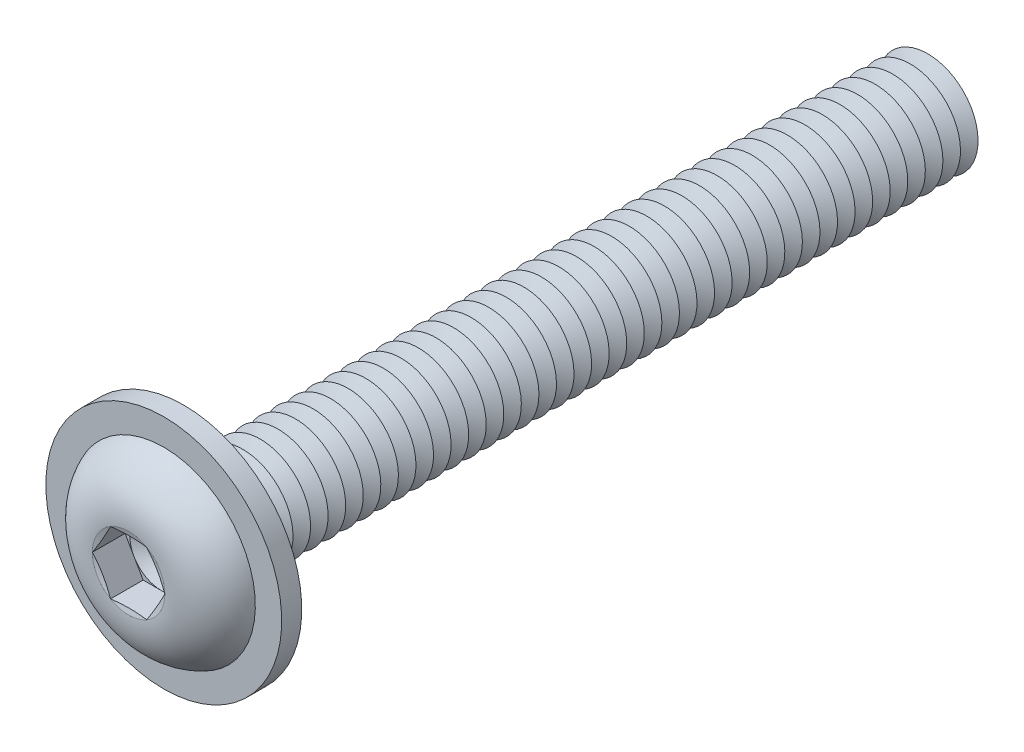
ISO-10303-21;
HEADER;
FILE_DESCRIPTION(('STEP AP214'),'2;1');
FILE_NAME('part.step','',(''),(''),'','','');
FILE_SCHEMA(('AUTOMOTIVE_DESIGN { 1 0 10303 214 1 1 1 1 }'));
ENDSEC;
DATA;
#1=APPLICATION_CONTEXT('core data for automotive mechanical design processes');
#2=APPLICATION_PROTOCOL_DEFINITION('international standard','automotive_design',2000,#1);
#3=PRODUCT_CONTEXT('',#1,'mechanical');
#4=PRODUCT('Part','Part','',(#3));
#5=PRODUCT_RELATED_PRODUCT_CATEGORY('part','',(#4));
#6=PRODUCT_DEFINITION_FORMATION('','',#4);
#7=PRODUCT_DEFINITION_CONTEXT('part definition',#1,'design');
#8=PRODUCT_DEFINITION('design','',#6,#7);
#9=PRODUCT_DEFINITION_SHAPE('','',#8);
#10=(LENGTH_UNIT() NAMED_UNIT(*) SI_UNIT(.MILLI.,.METRE.));
#11=(NAMED_UNIT(*) PLANE_ANGLE_UNIT() SI_UNIT($,.RADIAN.));
#12=(NAMED_UNIT(*) SI_UNIT($,.STERADIAN.) SOLID_ANGLE_UNIT());
#13=UNCERTAINTY_MEASURE_WITH_UNIT(LENGTH_MEASURE(1.E-05),#10,'distance_accuracy_value','');
#14=(GEOMETRIC_REPRESENTATION_CONTEXT(3) GLOBAL_UNCERTAINTY_ASSIGNED_CONTEXT((#13)) GLOBAL_UNIT_ASSIGNED_CONTEXT((#10,
#11,#12)) REPRESENTATION_CONTEXT('',''));
#15=CARTESIAN_POINT('',(0.,0.,0.));
#16=DIRECTION('',(0.,0.,1.));
#17=DIRECTION('',(1.,0.,0.));
#18=AXIS2_PLACEMENT_3D('',#15,#16,#17);
#19=CARTESIAN_POINT('',(0.,0.,-27.55));
#20=DIRECTION('',(0.,0.,1.));
#21=DIRECTION('',(0.,-1.,0.));
#22=AXIS2_PLACEMENT_3D('',#19,#20,#21);
#23=CONICAL_SURFACE('',#22,1.99999999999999,1.0471975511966);
#24=CARTESIAN_POINT('',(0.,0.,-27.9));
#25=DIRECTION('',(0.,0.,1.));
#26=DIRECTION('',(0.,-1.,0.));
#27=AXIS2_PLACEMENT_3D('',#24,#25,#26);
#28=CIRCLE('',#27,1.39378221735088);
#29=CARTESIAN_POINT('',(0.,-1.39378221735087,-27.9));
#30=VERTEX_POINT('',#29);
#31=EDGE_CURVE('E546',#30,#30,#28,.T.);
#32=ORIENTED_EDGE('',*,*,#31,.T.);
#33=EDGE_LOOP('',(#32));
#34=FACE_BOUND('',#33,.T.);
#35=CARTESIAN_POINT('',(0.,0.,-27.55));
#36=DIRECTION('',(0.,0.,1.));
#37=DIRECTION('',(0.,-1.,0.));
#38=AXIS2_PLACEMENT_3D('',#35,#36,#37);
#39=CIRCLE('',#38,1.99999999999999);
#40=CARTESIAN_POINT('',(0.,-1.99999999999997,-27.55));
#41=VERTEX_POINT('',#40);
#42=EDGE_CURVE('E542',#41,#41,#39,.T.);
#43=ORIENTED_EDGE('',*,*,#42,.F.);
#44=EDGE_LOOP('',(#43));
#45=FACE_BOUND('',#44,.T.);
#46=ADVANCED_FACE('F39',(#34,#45),#23,.T.);
#47=CARTESIAN_POINT('',(0.,0.,-27.9));
#48=DIRECTION('',(0.,0.,-1.));
#49=DIRECTION('',(0.,1.,0.));
#50=AXIS2_PLACEMENT_3D('',#47,#48,#49);
#51=CONICAL_SURFACE('',#50,1.39378221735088,1.0471975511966);
#52=CARTESIAN_POINT('',(0.,0.,-28.25));
#53=DIRECTION('',(0.,0.,1.));
#54=DIRECTION('',(0.,-1.,0.));
#55=AXIS2_PLACEMENT_3D('',#52,#53,#54);
#56=CIRCLE('',#55,1.99999999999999);
#57=CARTESIAN_POINT('',(0.,-1.99999999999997,-28.25));
#58=VERTEX_POINT('',#57);
#59=EDGE_CURVE('E550',#58,#58,#56,.T.);
#60=ORIENTED_EDGE('',*,*,#59,.T.);
#61=EDGE_LOOP('',(#60));
#62=FACE_BOUND('',#61,.T.);
#63=ORIENTED_EDGE('',*,*,#31,.F.);
#64=EDGE_LOOP('',(#63));
#65=FACE_BOUND('',#64,.T.);
#66=ADVANCED_FACE('F667',(#62,#65),#51,.T.);
#67=CARTESIAN_POINT('',(0.,2.,-30.));
#68=DIRECTION('',(0.,0.,-1.));
#69=DIRECTION('',(0.,1.,0.));
#70=AXIS2_PLACEMENT_3D('',#67,#68,#69);
#71=PLANE('',#70);
#72=CARTESIAN_POINT('',(0.,0.,-30.));
#73=DIRECTION('',(0.,0.,1.));
#74=DIRECTION('',(0.,-1.,0.));
#75=AXIS2_PLACEMENT_3D('',#72,#73,#74);
#76=CIRCLE('',#75,1.39378221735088);
#77=CARTESIAN_POINT('',(0.,-1.39378221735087,-30.));
#78=VERTEX_POINT('',#77);
#79=EDGE_CURVE('E569',#78,#78,#76,.T.);
#80=ORIENTED_EDGE('',*,*,#79,.F.);
#81=EDGE_LOOP('',(#80));
#82=FACE_BOUND('',#81,.T.);
#83=ADVANCED_FACE('F673',(#82),#71,.T.);
#84=CARTESIAN_POINT('',(0.,0.,-29.65));
#85=DIRECTION('',(0.,0.,1.));
#86=DIRECTION('',(0.,-1.,0.));
#87=AXIS2_PLACEMENT_3D('',#84,#85,#86);
#88=CONICAL_SURFACE('',#87,1.99999999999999,1.0471975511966);
#89=ORIENTED_EDGE('',*,*,#79,.T.);
#90=EDGE_LOOP('',(#89));
#91=FACE_BOUND('',#90,.T.);
#92=CARTESIAN_POINT('',(0.,0.,-29.65));
#93=DIRECTION('',(0.,0.,1.));
#94=DIRECTION('',(0.,-1.,0.));
#95=AXIS2_PLACEMENT_3D('',#92,#93,#94);
#96=CIRCLE('',#95,1.99999999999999);
#97=CARTESIAN_POINT('',(0.,-1.99999999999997,-29.65));
#98=VERTEX_POINT('',#97);
#99=EDGE_CURVE('E566',#98,#98,#96,.T.);
#100=ORIENTED_EDGE('',*,*,#99,.F.);
#101=EDGE_LOOP('',(#100));
#102=FACE_BOUND('',#101,.T.);
#103=ADVANCED_FACE('F692',(#91,#102),#88,.T.);
#104=CARTESIAN_POINT('',(0.,0.,-29.3));
#105=DIRECTION('',(0.,0.,-1.));
#106=DIRECTION('',(0.,1.,0.));
#107=AXIS2_PLACEMENT_3D('',#104,#105,#106);
#108=CONICAL_SURFACE('',#107,1.39378221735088,1.0471975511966);
#109=ORIENTED_EDGE('',*,*,#99,.T.);
#110=EDGE_LOOP('',(#109));
#111=FACE_BOUND('',#110,.T.);
#112=CARTESIAN_POINT('',(0.,0.,-29.3));
#113=DIRECTION('',(0.,0.,1.));
#114=DIRECTION('',(0.,-1.,0.));
#115=AXIS2_PLACEMENT_3D('',#112,#113,#114);
#116=CIRCLE('',#115,1.39378221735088);
#117=CARTESIAN_POINT('',(0.,-1.39378221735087,-29.3));
#118=VERTEX_POINT('',#117);
#119=EDGE_CURVE('E562',#118,#118,#116,.T.);
#120=ORIENTED_EDGE('',*,*,#119,.F.);
#121=EDGE_LOOP('',(#120));
#122=FACE_BOUND('',#121,.T.);
#123=ADVANCED_FACE('F689',(#111,#122),#108,.T.);
#124=CARTESIAN_POINT('',(0.,0.,-28.95));
#125=DIRECTION('',(0.,0.,1.));
#126=DIRECTION('',(0.,-1.,0.));
#127=AXIS2_PLACEMENT_3D('',#124,#125,#126);
#128=CONICAL_SURFACE('',#127,1.99999999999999,1.0471975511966);
#129=ORIENTED_EDGE('',*,*,#119,.T.);
#130=EDGE_LOOP('',(#129));
#131=FACE_BOUND('',#130,.T.);
#132=CARTESIAN_POINT('',(0.,0.,-28.95));
#133=DIRECTION('',(0.,0.,1.));
#134=DIRECTION('',(0.,-1.,0.));
#135=AXIS2_PLACEMENT_3D('',#132,#133,#134);
#136=CIRCLE('',#135,1.99999999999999);
#137=CARTESIAN_POINT('',(0.,-1.99999999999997,-28.95));
#138=VERTEX_POINT('',#137);
#139=EDGE_CURVE('E558',#138,#138,#136,.T.);
#140=ORIENTED_EDGE('',*,*,#139,.F.);
#141=EDGE_LOOP('',(#140));
#142=FACE_BOUND('',#141,.T.);
#143=ADVANCED_FACE('F683',(#131,#142),#128,.T.);
#144=CARTESIAN_POINT('',(0.,0.,-28.6));
#145=DIRECTION('',(0.,0.,-1.));
#146=DIRECTION('',(0.,1.,0.));
#147=AXIS2_PLACEMENT_3D('',#144,#145,#146);
#148=CONICAL_SURFACE('',#147,1.39378221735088,1.0471975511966);
#149=ORIENTED_EDGE('',*,*,#139,.T.);
#150=EDGE_LOOP('',(#149));
#151=FACE_BOUND('',#150,.T.);
#152=CARTESIAN_POINT('',(0.,0.,-28.6));
#153=DIRECTION('',(0.,0.,1.));
#154=DIRECTION('',(0.,-1.,0.));
#155=AXIS2_PLACEMENT_3D('',#152,#153,#154);
#156=CIRCLE('',#155,1.39378221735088);
#157=CARTESIAN_POINT('',(0.,-1.39378221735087,-28.6));
#158=VERTEX_POINT('',#157);
#159=EDGE_CURVE('E554',#158,#158,#156,.T.);
#160=ORIENTED_EDGE('',*,*,#159,.F.);
#161=EDGE_LOOP('',(#160));
#162=FACE_BOUND('',#161,.T.);
#163=ADVANCED_FACE('F679',(#151,#162),#148,.T.);
#164=CARTESIAN_POINT('',(0.,0.,-28.25));
#165=DIRECTION('',(0.,0.,1.));
#166=DIRECTION('',(0.,-1.,0.));
#167=AXIS2_PLACEMENT_3D('',#164,#165,#166);
#168=CONICAL_SURFACE('',#167,1.99999999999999,1.0471975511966);
#169=ORIENTED_EDGE('',*,*,#159,.T.);
#170=EDGE_LOOP('',(#169));
#171=FACE_BOUND('',#170,.T.);
#172=ORIENTED_EDGE('',*,*,#59,.F.);
#173=EDGE_LOOP('',(#172));
#174=FACE_BOUND('',#173,.T.);
#175=ADVANCED_FACE('F682',(#171,#174),#168,.T.);
#176=CARTESIAN_POINT('',(0.,0.,-26.85));
#177=DIRECTION('',(0.,0.,1.));
#178=DIRECTION('',(0.,-1.,0.));
#179=AXIS2_PLACEMENT_3D('',#176,#177,#178);
#180=CONICAL_SURFACE('',#179,1.99999999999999,1.0471975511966);
#181=CARTESIAN_POINT('',(0.,0.,-27.2));
#182=DIRECTION('',(0.,0.,1.));
#183=DIRECTION('',(0.,-1.,0.));
#184=AXIS2_PLACEMENT_3D('',#181,#182,#183);
#185=CIRCLE('',#184,1.39378221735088);
#186=CARTESIAN_POINT('',(0.,-1.39378221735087,-27.2));
#187=VERTEX_POINT('',#186);
#188=EDGE_CURVE('E538',#187,#187,#185,.T.);
#189=ORIENTED_EDGE('',*,*,#188,.T.);
#190=EDGE_LOOP('',(#189));
#191=FACE_BOUND('',#190,.T.);
#192=CARTESIAN_POINT('',(0.,0.,-26.85));
#193=DIRECTION('',(0.,0.,1.));
#194=DIRECTION('',(0.,-1.,0.));
#195=AXIS2_PLACEMENT_3D('',#192,#193,#194);
#196=CIRCLE('',#195,1.99999999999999);
#197=CARTESIAN_POINT('',(0.,-1.99999999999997,-26.85));
#198=VERTEX_POINT('',#197);
#199=EDGE_CURVE('E534',#198,#198,#196,.T.);
#200=ORIENTED_EDGE('',*,*,#199,.F.);
#201=EDGE_LOOP('',(#200));
#202=FACE_BOUND('',#201,.T.);
#203=ADVANCED_FACE('F687',(#191,#202),#180,.T.);
#204=CARTESIAN_POINT('',(0.,0.,-27.2));
#205=DIRECTION('',(0.,0.,-1.));
#206=DIRECTION('',(0.,1.,0.));
#207=AXIS2_PLACEMENT_3D('',#204,#205,#206);
#208=CONICAL_SURFACE('',#207,1.39378221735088,1.0471975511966);
#209=ORIENTED_EDGE('',*,*,#42,.T.);
#210=EDGE_LOOP('',(#209));
#211=FACE_BOUND('',#210,.T.);
#212=ORIENTED_EDGE('',*,*,#188,.F.);
#213=EDGE_LOOP('',(#212));
#214=FACE_BOUND('',#213,.T.);
#215=ADVANCED_FACE('F738',(#211,#214),#208,.T.);
#216=CARTESIAN_POINT('',(0.,0.,-26.15));
#217=DIRECTION('',(0.,0.,1.));
#218=DIRECTION('',(0.,-1.,0.));
#219=AXIS2_PLACEMENT_3D('',#216,#217,#218);
#220=CONICAL_SURFACE('',#219,1.99999999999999,1.0471975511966);
#221=CARTESIAN_POINT('',(0.,0.,-26.5));
#222=DIRECTION('',(0.,0.,1.));
#223=DIRECTION('',(0.,-1.,0.));
#224=AXIS2_PLACEMENT_3D('',#221,#222,#223);
#225=CIRCLE('',#224,1.39378221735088);
#226=CARTESIAN_POINT('',(0.,-1.39378221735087,-26.5));
#227=VERTEX_POINT('',#226);
#228=EDGE_CURVE('E530',#227,#227,#225,.T.);
#229=ORIENTED_EDGE('',*,*,#228,.T.);
#230=EDGE_LOOP('',(#229));
#231=FACE_BOUND('',#230,.T.);
#232=CARTESIAN_POINT('',(0.,0.,-26.15));
#233=DIRECTION('',(0.,0.,1.));
#234=DIRECTION('',(0.,-1.,0.));
#235=AXIS2_PLACEMENT_3D('',#232,#233,#234);
#236=CIRCLE('',#235,1.99999999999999);
#237=CARTESIAN_POINT('',(0.,-1.99999999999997,-26.15));
#238=VERTEX_POINT('',#237);
#239=EDGE_CURVE('E526',#238,#238,#236,.T.);
#240=ORIENTED_EDGE('',*,*,#239,.F.);
#241=EDGE_LOOP('',(#240));
#242=FACE_BOUND('',#241,.T.);
#243=ADVANCED_FACE('F744',(#231,#242),#220,.T.);
#244=CARTESIAN_POINT('',(0.,0.,-26.5));
#245=DIRECTION('',(0.,0.,-1.));
#246=DIRECTION('',(0.,1.,0.));
#247=AXIS2_PLACEMENT_3D('',#244,#245,#246);
#248=CONICAL_SURFACE('',#247,1.39378221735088,1.0471975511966);
#249=ORIENTED_EDGE('',*,*,#199,.T.);
#250=EDGE_LOOP('',(#249));
#251=FACE_BOUND('',#250,.T.);
#252=ORIENTED_EDGE('',*,*,#228,.F.);
#253=EDGE_LOOP('',(#252));
#254=FACE_BOUND('',#253,.T.);
#255=ADVANCED_FACE('F751',(#251,#254),#248,.T.);
#256=CARTESIAN_POINT('',(0.,0.,-25.45));
#257=DIRECTION('',(0.,0.,1.));
#258=DIRECTION('',(0.,-1.,0.));
#259=AXIS2_PLACEMENT_3D('',#256,#257,#258);
#260=CONICAL_SURFACE('',#259,1.99999999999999,1.0471975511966);
#261=CARTESIAN_POINT('',(0.,0.,-25.8));
#262=DIRECTION('',(0.,0.,1.));
#263=DIRECTION('',(0.,-1.,0.));
#264=AXIS2_PLACEMENT_3D('',#261,#262,#263);
#265=CIRCLE('',#264,1.39378221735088);
#266=CARTESIAN_POINT('',(0.,-1.39378221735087,-25.8));
#267=VERTEX_POINT('',#266);
#268=EDGE_CURVE('E522',#267,#267,#265,.T.);
#269=ORIENTED_EDGE('',*,*,#268,.T.);
#270=EDGE_LOOP('',(#269));
#271=FACE_BOUND('',#270,.T.);
#272=CARTESIAN_POINT('',(0.,0.,-25.45));
#273=DIRECTION('',(0.,0.,1.));
#274=DIRECTION('',(0.,-1.,0.));
#275=AXIS2_PLACEMENT_3D('',#272,#273,#274);
#276=CIRCLE('',#275,1.99999999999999);
#277=CARTESIAN_POINT('',(0.,-1.99999999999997,-25.45));
#278=VERTEX_POINT('',#277);
#279=EDGE_CURVE('E518',#278,#278,#276,.T.);
#280=ORIENTED_EDGE('',*,*,#279,.F.);
#281=EDGE_LOOP('',(#280));
#282=FACE_BOUND('',#281,.T.);
#283=ADVANCED_FACE('F758',(#271,#282),#260,.T.);
#284=CARTESIAN_POINT('',(0.,0.,-25.8));
#285=DIRECTION('',(0.,0.,-1.));
#286=DIRECTION('',(0.,1.,0.));
#287=AXIS2_PLACEMENT_3D('',#284,#285,#286);
#288=CONICAL_SURFACE('',#287,1.39378221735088,1.0471975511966);
#289=ORIENTED_EDGE('',*,*,#239,.T.);
#290=EDGE_LOOP('',(#289));
#291=FACE_BOUND('',#290,.T.);
#292=ORIENTED_EDGE('',*,*,#268,.F.);
#293=EDGE_LOOP('',(#292));
#294=FACE_BOUND('',#293,.T.);
#295=ADVANCED_FACE('F765',(#291,#294),#288,.T.);
#296=CARTESIAN_POINT('',(0.,0.,-24.75));
#297=DIRECTION('',(0.,0.,1.));
#298=DIRECTION('',(0.,-1.,0.));
#299=AXIS2_PLACEMENT_3D('',#296,#297,#298);
#300=CONICAL_SURFACE('',#299,1.99999999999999,1.0471975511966);
#301=CARTESIAN_POINT('',(0.,0.,-25.1));
#302=DIRECTION('',(0.,0.,1.));
#303=DIRECTION('',(0.,-1.,0.));
#304=AXIS2_PLACEMENT_3D('',#301,#302,#303);
#305=CIRCLE('',#304,1.39378221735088);
#306=CARTESIAN_POINT('',(0.,-1.39378221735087,-25.1));
#307=VERTEX_POINT('',#306);
#308=EDGE_CURVE('E514',#307,#307,#305,.T.);
#309=ORIENTED_EDGE('',*,*,#308,.T.);
#310=EDGE_LOOP('',(#309));
#311=FACE_BOUND('',#310,.T.);
#312=CARTESIAN_POINT('',(0.,0.,-24.75));
#313=DIRECTION('',(0.,0.,1.));
#314=DIRECTION('',(0.,-1.,0.));
#315=AXIS2_PLACEMENT_3D('',#312,#313,#314);
#316=CIRCLE('',#315,1.99999999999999);
#317=CARTESIAN_POINT('',(0.,-1.99999999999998,-24.75));
#318=VERTEX_POINT('',#317);
#319=EDGE_CURVE('E510',#318,#318,#316,.T.);
#320=ORIENTED_EDGE('',*,*,#319,.F.);
#321=EDGE_LOOP('',(#320));
#322=FACE_BOUND('',#321,.T.);
#323=ADVANCED_FACE('F772',(#311,#322),#300,.T.);
#324=CARTESIAN_POINT('',(0.,0.,-25.1));
#325=DIRECTION('',(0.,0.,-1.));
#326=DIRECTION('',(0.,1.,0.));
#327=AXIS2_PLACEMENT_3D('',#324,#325,#326);
#328=CONICAL_SURFACE('',#327,1.39378221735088,1.0471975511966);
#329=ORIENTED_EDGE('',*,*,#279,.T.);
#330=EDGE_LOOP('',(#329));
#331=FACE_BOUND('',#330,.T.);
#332=ORIENTED_EDGE('',*,*,#308,.F.);
#333=EDGE_LOOP('',(#332));
#334=FACE_BOUND('',#333,.T.);
#335=ADVANCED_FACE('F779',(#331,#334),#328,.T.);
#336=CARTESIAN_POINT('',(0.,0.,-24.05));
#337=DIRECTION('',(0.,0.,1.));
#338=DIRECTION('',(0.,-1.,0.));
#339=AXIS2_PLACEMENT_3D('',#336,#337,#338);
#340=CONICAL_SURFACE('',#339,1.99999999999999,1.0471975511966);
#341=CARTESIAN_POINT('',(0.,0.,-24.4));
#342=DIRECTION('',(0.,0.,1.));
#343=DIRECTION('',(0.,-1.,0.));
#344=AXIS2_PLACEMENT_3D('',#341,#342,#343);
#345=CIRCLE('',#344,1.39378221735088);
#346=CARTESIAN_POINT('',(0.,-1.39378221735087,-24.4));
#347=VERTEX_POINT('',#346);
#348=EDGE_CURVE('E506',#347,#347,#345,.T.);
#349=ORIENTED_EDGE('',*,*,#348,.T.);
#350=EDGE_LOOP('',(#349));
#351=FACE_BOUND('',#350,.T.);
#352=CARTESIAN_POINT('',(0.,0.,-24.05));
#353=DIRECTION('',(0.,0.,1.));
#354=DIRECTION('',(0.,-1.,0.));
#355=AXIS2_PLACEMENT_3D('',#352,#353,#354);
#356=CIRCLE('',#355,1.99999999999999);
#357=CARTESIAN_POINT('',(0.,-1.99999999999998,-24.05));
#358=VERTEX_POINT('',#357);
#359=EDGE_CURVE('E502',#358,#358,#356,.T.);
#360=ORIENTED_EDGE('',*,*,#359,.F.);
#361=EDGE_LOOP('',(#360));
#362=FACE_BOUND('',#361,.T.);
#363=ADVANCED_FACE('F786',(#351,#362),#340,.T.);
#364=CARTESIAN_POINT('',(0.,0.,-24.4));
#365=DIRECTION('',(0.,0.,-1.));
#366=DIRECTION('',(0.,1.,0.));
#367=AXIS2_PLACEMENT_3D('',#364,#365,#366);
#368=CONICAL_SURFACE('',#367,1.39378221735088,1.0471975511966);
#369=ORIENTED_EDGE('',*,*,#319,.T.);
#370=EDGE_LOOP('',(#369));
#371=FACE_BOUND('',#370,.T.);
#372=ORIENTED_EDGE('',*,*,#348,.F.);
#373=EDGE_LOOP('',(#372));
#374=FACE_BOUND('',#373,.T.);
#375=ADVANCED_FACE('F793',(#371,#374),#368,.T.);
#376=CARTESIAN_POINT('',(0.,0.,-23.35));
#377=DIRECTION('',(0.,0.,1.));
#378=DIRECTION('',(0.,-1.,0.));
#379=AXIS2_PLACEMENT_3D('',#376,#377,#378);
#380=CONICAL_SURFACE('',#379,1.99999999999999,1.0471975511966);
#381=CARTESIAN_POINT('',(0.,0.,-23.7));
#382=DIRECTION('',(0.,0.,1.));
#383=DIRECTION('',(0.,-1.,0.));
#384=AXIS2_PLACEMENT_3D('',#381,#382,#383);
#385=CIRCLE('',#384,1.39378221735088);
#386=CARTESIAN_POINT('',(0.,-1.39378221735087,-23.7));
#387=VERTEX_POINT('',#386);
#388=EDGE_CURVE('E498',#387,#387,#385,.T.);
#389=ORIENTED_EDGE('',*,*,#388,.T.);
#390=EDGE_LOOP('',(#389));
#391=FACE_BOUND('',#390,.T.);
#392=CARTESIAN_POINT('',(0.,0.,-23.35));
#393=DIRECTION('',(0.,0.,1.));
#394=DIRECTION('',(0.,-1.,0.));
#395=AXIS2_PLACEMENT_3D('',#392,#393,#394);
#396=CIRCLE('',#395,1.99999999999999);
#397=CARTESIAN_POINT('',(0.,-1.99999999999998,-23.35));
#398=VERTEX_POINT('',#397);
#399=EDGE_CURVE('E494',#398,#398,#396,.T.);
#400=ORIENTED_EDGE('',*,*,#399,.F.);
#401=EDGE_LOOP('',(#400));
#402=FACE_BOUND('',#401,.T.);
#403=ADVANCED_FACE('F800',(#391,#402),#380,.T.);
#404=CARTESIAN_POINT('',(0.,0.,-23.7));
#405=DIRECTION('',(0.,0.,-1.));
#406=DIRECTION('',(0.,1.,0.));
#407=AXIS2_PLACEMENT_3D('',#404,#405,#406);
#408=CONICAL_SURFACE('',#407,1.39378221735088,1.0471975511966);
#409=ORIENTED_EDGE('',*,*,#359,.T.);
#410=EDGE_LOOP('',(#409));
#411=FACE_BOUND('',#410,.T.);
#412=ORIENTED_EDGE('',*,*,#388,.F.);
#413=EDGE_LOOP('',(#412));
#414=FACE_BOUND('',#413,.T.);
#415=ADVANCED_FACE('F807',(#411,#414),#408,.T.);
#416=CARTESIAN_POINT('',(0.,0.,-22.65));
#417=DIRECTION('',(0.,0.,1.));
#418=DIRECTION('',(0.,-1.,0.));
#419=AXIS2_PLACEMENT_3D('',#416,#417,#418);
#420=CONICAL_SURFACE('',#419,1.99999999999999,1.0471975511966);
#421=CARTESIAN_POINT('',(0.,0.,-23.));
#422=DIRECTION('',(0.,0.,1.));
#423=DIRECTION('',(0.,-1.,0.));
#424=AXIS2_PLACEMENT_3D('',#421,#422,#423);
#425=CIRCLE('',#424,1.39378221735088);
#426=CARTESIAN_POINT('',(0.,-1.39378221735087,-23.));
#427=VERTEX_POINT('',#426);
#428=EDGE_CURVE('E490',#427,#427,#425,.T.);
#429=ORIENTED_EDGE('',*,*,#428,.T.);
#430=EDGE_LOOP('',(#429));
#431=FACE_BOUND('',#430,.T.);
#432=CARTESIAN_POINT('',(0.,0.,-22.65));
#433=DIRECTION('',(0.,0.,1.));
#434=DIRECTION('',(0.,-1.,0.));
#435=AXIS2_PLACEMENT_3D('',#432,#433,#434);
#436=CIRCLE('',#435,1.99999999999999);
#437=CARTESIAN_POINT('',(0.,-1.99999999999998,-22.65));
#438=VERTEX_POINT('',#437);
#439=EDGE_CURVE('E486',#438,#438,#436,.T.);
#440=ORIENTED_EDGE('',*,*,#439,.F.);
#441=EDGE_LOOP('',(#440));
#442=FACE_BOUND('',#441,.T.);
#443=ADVANCED_FACE('F814',(#431,#442),#420,.T.);
#444=CARTESIAN_POINT('',(0.,0.,-23.));
#445=DIRECTION('',(0.,0.,-1.));
#446=DIRECTION('',(0.,1.,0.));
#447=AXIS2_PLACEMENT_3D('',#444,#445,#446);
#448=CONICAL_SURFACE('',#447,1.39378221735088,1.0471975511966);
#449=ORIENTED_EDGE('',*,*,#399,.T.);
#450=EDGE_LOOP('',(#449));
#451=FACE_BOUND('',#450,.T.);
#452=ORIENTED_EDGE('',*,*,#428,.F.);
#453=EDGE_LOOP('',(#452));
#454=FACE_BOUND('',#453,.T.);
#455=ADVANCED_FACE('F821',(#451,#454),#448,.T.);
#456=CARTESIAN_POINT('',(0.,0.,-21.95));
#457=DIRECTION('',(0.,0.,1.));
#458=DIRECTION('',(0.,-1.,0.));
#459=AXIS2_PLACEMENT_3D('',#456,#457,#458);
#460=CONICAL_SURFACE('',#459,1.99999999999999,1.0471975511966);
#461=CARTESIAN_POINT('',(0.,0.,-22.3));
#462=DIRECTION('',(0.,0.,1.));
#463=DIRECTION('',(0.,-1.,0.));
#464=AXIS2_PLACEMENT_3D('',#461,#462,#463);
#465=CIRCLE('',#464,1.39378221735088);
#466=CARTESIAN_POINT('',(0.,-1.39378221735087,-22.3));
#467=VERTEX_POINT('',#466);
#468=EDGE_CURVE('E482',#467,#467,#465,.T.);
#469=ORIENTED_EDGE('',*,*,#468,.T.);
#470=EDGE_LOOP('',(#469));
#471=FACE_BOUND('',#470,.T.);
#472=CARTESIAN_POINT('',(0.,0.,-21.95));
#473=DIRECTION('',(0.,0.,1.));
#474=DIRECTION('',(0.,-1.,0.));
#475=AXIS2_PLACEMENT_3D('',#472,#473,#474);
#476=CIRCLE('',#475,1.99999999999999);
#477=CARTESIAN_POINT('',(0.,-1.99999999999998,-21.95));
#478=VERTEX_POINT('',#477);
#479=EDGE_CURVE('E478',#478,#478,#476,.T.);
#480=ORIENTED_EDGE('',*,*,#479,.F.);
#481=EDGE_LOOP('',(#480));
#482=FACE_BOUND('',#481,.T.);
#483=ADVANCED_FACE('F828',(#471,#482),#460,.T.);
#484=CARTESIAN_POINT('',(0.,0.,-22.3));
#485=DIRECTION('',(0.,0.,-1.));
#486=DIRECTION('',(0.,1.,0.));
#487=AXIS2_PLACEMENT_3D('',#484,#485,#486);
#488=CONICAL_SURFACE('',#487,1.39378221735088,1.0471975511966);
#489=ORIENTED_EDGE('',*,*,#439,.T.);
#490=EDGE_LOOP('',(#489));
#491=FACE_BOUND('',#490,.T.);
#492=ORIENTED_EDGE('',*,*,#468,.F.);
#493=EDGE_LOOP('',(#492));
#494=FACE_BOUND('',#493,.T.);
#495=ADVANCED_FACE('F835',(#491,#494),#488,.T.);
#496=CARTESIAN_POINT('',(0.,0.,-21.25));
#497=DIRECTION('',(0.,0.,1.));
#498=DIRECTION('',(0.,-1.,0.));
#499=AXIS2_PLACEMENT_3D('',#496,#497,#498);
#500=CONICAL_SURFACE('',#499,1.99999999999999,1.0471975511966);
#501=CARTESIAN_POINT('',(0.,0.,-21.6));
#502=DIRECTION('',(0.,0.,1.));
#503=DIRECTION('',(0.,-1.,0.));
#504=AXIS2_PLACEMENT_3D('',#501,#502,#503);
#505=CIRCLE('',#504,1.39378221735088);
#506=CARTESIAN_POINT('',(0.,-1.39378221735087,-21.6));
#507=VERTEX_POINT('',#506);
#508=EDGE_CURVE('E474',#507,#507,#505,.T.);
#509=ORIENTED_EDGE('',*,*,#508,.T.);
#510=EDGE_LOOP('',(#509));
#511=FACE_BOUND('',#510,.T.);
#512=CARTESIAN_POINT('',(0.,0.,-21.25));
#513=DIRECTION('',(0.,0.,1.));
#514=DIRECTION('',(0.,-1.,0.));
#515=AXIS2_PLACEMENT_3D('',#512,#513,#514);
#516=CIRCLE('',#515,1.99999999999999);
#517=CARTESIAN_POINT('',(0.,-1.99999999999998,-21.25));
#518=VERTEX_POINT('',#517);
#519=EDGE_CURVE('E470',#518,#518,#516,.T.);
#520=ORIENTED_EDGE('',*,*,#519,.F.);
#521=EDGE_LOOP('',(#520));
#522=FACE_BOUND('',#521,.T.);
#523=ADVANCED_FACE('F842',(#511,#522),#500,.T.);
#524=CARTESIAN_POINT('',(0.,0.,-21.6));
#525=DIRECTION('',(0.,0.,-1.));
#526=DIRECTION('',(0.,1.,0.));
#527=AXIS2_PLACEMENT_3D('',#524,#525,#526);
#528=CONICAL_SURFACE('',#527,1.39378221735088,1.0471975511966);
#529=ORIENTED_EDGE('',*,*,#479,.T.);
#530=EDGE_LOOP('',(#529));
#531=FACE_BOUND('',#530,.T.);
#532=ORIENTED_EDGE('',*,*,#508,.F.);
#533=EDGE_LOOP('',(#532));
#534=FACE_BOUND('',#533,.T.);
#535=ADVANCED_FACE('F849',(#531,#534),#528,.T.);
#536=CARTESIAN_POINT('',(0.,0.,-20.55));
#537=DIRECTION('',(0.,0.,1.));
#538=DIRECTION('',(0.,-1.,0.));
#539=AXIS2_PLACEMENT_3D('',#536,#537,#538);
#540=CONICAL_SURFACE('',#539,1.99999999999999,1.0471975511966);
#541=CARTESIAN_POINT('',(0.,0.,-20.9));
#542=DIRECTION('',(0.,0.,1.));
#543=DIRECTION('',(0.,-1.,0.));
#544=AXIS2_PLACEMENT_3D('',#541,#542,#543);
#545=CIRCLE('',#544,1.39378221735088);
#546=CARTESIAN_POINT('',(0.,-1.39378221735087,-20.9));
#547=VERTEX_POINT('',#546);
#548=EDGE_CURVE('E466',#547,#547,#545,.T.);
#549=ORIENTED_EDGE('',*,*,#548,.T.);
#550=EDGE_LOOP('',(#549));
#551=FACE_BOUND('',#550,.T.);
#552=CARTESIAN_POINT('',(0.,0.,-20.55));
#553=DIRECTION('',(0.,0.,1.));
#554=DIRECTION('',(0.,-1.,0.));
#555=AXIS2_PLACEMENT_3D('',#552,#553,#554);
#556=CIRCLE('',#555,1.99999999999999);
#557=CARTESIAN_POINT('',(0.,-1.99999999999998,-20.55));
#558=VERTEX_POINT('',#557);
#559=EDGE_CURVE('E462',#558,#558,#556,.T.);
#560=ORIENTED_EDGE('',*,*,#559,.F.);
#561=EDGE_LOOP('',(#560));
#562=FACE_BOUND('',#561,.T.);
#563=ADVANCED_FACE('F856',(#551,#562),#540,.T.);
#564=CARTESIAN_POINT('',(0.,0.,-20.9));
#565=DIRECTION('',(0.,0.,-1.));
#566=DIRECTION('',(0.,1.,0.));
#567=AXIS2_PLACEMENT_3D('',#564,#565,#566);
#568=CONICAL_SURFACE('',#567,1.39378221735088,1.0471975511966);
#569=ORIENTED_EDGE('',*,*,#519,.T.);
#570=EDGE_LOOP('',(#569));
#571=FACE_BOUND('',#570,.T.);
#572=ORIENTED_EDGE('',*,*,#548,.F.);
#573=EDGE_LOOP('',(#572));
#574=FACE_BOUND('',#573,.T.);
#575=ADVANCED_FACE('F863',(#571,#574),#568,.T.);
#576=CARTESIAN_POINT('',(0.,0.,-19.85));
#577=DIRECTION('',(0.,0.,1.));
#578=DIRECTION('',(0.,-1.,0.));
#579=AXIS2_PLACEMENT_3D('',#576,#577,#578);
#580=CONICAL_SURFACE('',#579,1.99999999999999,1.0471975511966);
#581=CARTESIAN_POINT('',(0.,0.,-20.2));
#582=DIRECTION('',(0.,0.,1.));
#583=DIRECTION('',(0.,-1.,0.));
#584=AXIS2_PLACEMENT_3D('',#581,#582,#583);
#585=CIRCLE('',#584,1.39378221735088);
#586=CARTESIAN_POINT('',(0.,-1.39378221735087,-20.2));
#587=VERTEX_POINT('',#586);
#588=EDGE_CURVE('E458',#587,#587,#585,.T.);
#589=ORIENTED_EDGE('',*,*,#588,.T.);
#590=EDGE_LOOP('',(#589));
#591=FACE_BOUND('',#590,.T.);
#592=CARTESIAN_POINT('',(0.,0.,-19.85));
#593=DIRECTION('',(0.,0.,1.));
#594=DIRECTION('',(0.,-1.,0.));
#595=AXIS2_PLACEMENT_3D('',#592,#593,#594);
#596=CIRCLE('',#595,1.99999999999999);
#597=CARTESIAN_POINT('',(0.,-1.99999999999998,-19.85));
#598=VERTEX_POINT('',#597);
#599=EDGE_CURVE('E454',#598,#598,#596,.T.);
#600=ORIENTED_EDGE('',*,*,#599,.F.);
#601=EDGE_LOOP('',(#600));
#602=FACE_BOUND('',#601,.T.);
#603=ADVANCED_FACE('F870',(#591,#602),#580,.T.);
#604=CARTESIAN_POINT('',(0.,0.,-20.2));
#605=DIRECTION('',(0.,0.,-1.));
#606=DIRECTION('',(0.,1.,0.));
#607=AXIS2_PLACEMENT_3D('',#604,#605,#606);
#608=CONICAL_SURFACE('',#607,1.39378221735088,1.0471975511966);
#609=ORIENTED_EDGE('',*,*,#559,.T.);
#610=EDGE_LOOP('',(#609));
#611=FACE_BOUND('',#610,.T.);
#612=ORIENTED_EDGE('',*,*,#588,.F.);
#613=EDGE_LOOP('',(#612));
#614=FACE_BOUND('',#613,.T.);
#615=ADVANCED_FACE('F877',(#611,#614),#608,.T.);
#616=CARTESIAN_POINT('',(0.,0.,-19.15));
#617=DIRECTION('',(0.,0.,1.));
#618=DIRECTION('',(0.,-1.,0.));
#619=AXIS2_PLACEMENT_3D('',#616,#617,#618);
#620=CONICAL_SURFACE('',#619,1.99999999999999,1.0471975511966);
#621=CARTESIAN_POINT('',(0.,0.,-19.5));
#622=DIRECTION('',(0.,0.,1.));
#623=DIRECTION('',(0.,-1.,0.));
#624=AXIS2_PLACEMENT_3D('',#621,#622,#623);
#625=CIRCLE('',#624,1.39378221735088);
#626=CARTESIAN_POINT('',(0.,-1.39378221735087,-19.5));
#627=VERTEX_POINT('',#626);
#628=EDGE_CURVE('E450',#627,#627,#625,.T.);
#629=ORIENTED_EDGE('',*,*,#628,.T.);
#630=EDGE_LOOP('',(#629));
#631=FACE_BOUND('',#630,.T.);
#632=CARTESIAN_POINT('',(0.,0.,-19.15));
#633=DIRECTION('',(0.,0.,1.));
#634=DIRECTION('',(0.,-1.,0.));
#635=AXIS2_PLACEMENT_3D('',#632,#633,#634);
#636=CIRCLE('',#635,1.99999999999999);
#637=CARTESIAN_POINT('',(0.,-1.99999999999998,-19.15));
#638=VERTEX_POINT('',#637);
#639=EDGE_CURVE('E446',#638,#638,#636,.T.);
#640=ORIENTED_EDGE('',*,*,#639,.F.);
#641=EDGE_LOOP('',(#640));
#642=FACE_BOUND('',#641,.T.);
#643=ADVANCED_FACE('F884',(#631,#642),#620,.T.);
#644=CARTESIAN_POINT('',(0.,0.,-19.5));
#645=DIRECTION('',(0.,0.,-1.));
#646=DIRECTION('',(0.,1.,0.));
#647=AXIS2_PLACEMENT_3D('',#644,#645,#646);
#648=CONICAL_SURFACE('',#647,1.39378221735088,1.0471975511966);
#649=ORIENTED_EDGE('',*,*,#599,.T.);
#650=EDGE_LOOP('',(#649));
#651=FACE_BOUND('',#650,.T.);
#652=ORIENTED_EDGE('',*,*,#628,.F.);
#653=EDGE_LOOP('',(#652));
#654=FACE_BOUND('',#653,.T.);
#655=ADVANCED_FACE('F891',(#651,#654),#648,.T.);
#656=CARTESIAN_POINT('',(0.,0.,-18.45));
#657=DIRECTION('',(0.,0.,1.));
#658=DIRECTION('',(0.,-1.,0.));
#659=AXIS2_PLACEMENT_3D('',#656,#657,#658);
#660=CONICAL_SURFACE('',#659,1.99999999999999,1.0471975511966);
#661=CARTESIAN_POINT('',(0.,0.,-18.8));
#662=DIRECTION('',(0.,0.,1.));
#663=DIRECTION('',(0.,-1.,0.));
#664=AXIS2_PLACEMENT_3D('',#661,#662,#663);
#665=CIRCLE('',#664,1.39378221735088);
#666=CARTESIAN_POINT('',(0.,-1.39378221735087,-18.8));
#667=VERTEX_POINT('',#666);
#668=EDGE_CURVE('E442',#667,#667,#665,.T.);
#669=ORIENTED_EDGE('',*,*,#668,.T.);
#670=EDGE_LOOP('',(#669));
#671=FACE_BOUND('',#670,.T.);
#672=CARTESIAN_POINT('',(0.,0.,-18.45));
#673=DIRECTION('',(0.,0.,1.));
#674=DIRECTION('',(0.,-1.,0.));
#675=AXIS2_PLACEMENT_3D('',#672,#673,#674);
#676=CIRCLE('',#675,1.99999999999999);
#677=CARTESIAN_POINT('',(0.,-1.99999999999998,-18.45));
#678=VERTEX_POINT('',#677);
#679=EDGE_CURVE('E438',#678,#678,#676,.T.);
#680=ORIENTED_EDGE('',*,*,#679,.F.);
#681=EDGE_LOOP('',(#680));
#682=FACE_BOUND('',#681,.T.);
#683=ADVANCED_FACE('F898',(#671,#682),#660,.T.);
#684=CARTESIAN_POINT('',(0.,0.,-18.8));
#685=DIRECTION('',(0.,0.,-1.));
#686=DIRECTION('',(0.,1.,0.));
#687=AXIS2_PLACEMENT_3D('',#684,#685,#686);
#688=CONICAL_SURFACE('',#687,1.39378221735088,1.0471975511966);
#689=ORIENTED_EDGE('',*,*,#639,.T.);
#690=EDGE_LOOP('',(#689));
#691=FACE_BOUND('',#690,.T.);
#692=ORIENTED_EDGE('',*,*,#668,.F.);
#693=EDGE_LOOP('',(#692));
#694=FACE_BOUND('',#693,.T.);
#695=ADVANCED_FACE('F905',(#691,#694),#688,.T.);
#696=CARTESIAN_POINT('',(0.,0.,-17.75));
#697=DIRECTION('',(0.,0.,1.));
#698=DIRECTION('',(0.,-1.,0.));
#699=AXIS2_PLACEMENT_3D('',#696,#697,#698);
#700=CONICAL_SURFACE('',#699,1.99999999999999,1.0471975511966);
#701=CARTESIAN_POINT('',(0.,0.,-18.1));
#702=DIRECTION('',(0.,0.,1.));
#703=DIRECTION('',(0.,-1.,0.));
#704=AXIS2_PLACEMENT_3D('',#701,#702,#703);
#705=CIRCLE('',#704,1.39378221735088);
#706=CARTESIAN_POINT('',(0.,-1.39378221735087,-18.1));
#707=VERTEX_POINT('',#706);
#708=EDGE_CURVE('E434',#707,#707,#705,.T.);
#709=ORIENTED_EDGE('',*,*,#708,.T.);
#710=EDGE_LOOP('',(#709));
#711=FACE_BOUND('',#710,.T.);
#712=CARTESIAN_POINT('',(0.,0.,-17.75));
#713=DIRECTION('',(0.,0.,1.));
#714=DIRECTION('',(0.,-1.,0.));
#715=AXIS2_PLACEMENT_3D('',#712,#713,#714);
#716=CIRCLE('',#715,1.99999999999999);
#717=CARTESIAN_POINT('',(0.,-1.99999999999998,-17.75));
#718=VERTEX_POINT('',#717);
#719=EDGE_CURVE('E430',#718,#718,#716,.T.);
#720=ORIENTED_EDGE('',*,*,#719,.F.);
#721=EDGE_LOOP('',(#720));
#722=FACE_BOUND('',#721,.T.);
#723=ADVANCED_FACE('F912',(#711,#722),#700,.T.);
#724=CARTESIAN_POINT('',(0.,0.,-18.1));
#725=DIRECTION('',(0.,0.,-1.));
#726=DIRECTION('',(0.,1.,0.));
#727=AXIS2_PLACEMENT_3D('',#724,#725,#726);
#728=CONICAL_SURFACE('',#727,1.39378221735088,1.0471975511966);
#729=ORIENTED_EDGE('',*,*,#679,.T.);
#730=EDGE_LOOP('',(#729));
#731=FACE_BOUND('',#730,.T.);
#732=ORIENTED_EDGE('',*,*,#708,.F.);
#733=EDGE_LOOP('',(#732));
#734=FACE_BOUND('',#733,.T.);
#735=ADVANCED_FACE('F919',(#731,#734),#728,.T.);
#736=CARTESIAN_POINT('',(0.,0.,-17.05));
#737=DIRECTION('',(0.,0.,1.));
#738=DIRECTION('',(0.,-1.,0.));
#739=AXIS2_PLACEMENT_3D('',#736,#737,#738);
#740=CONICAL_SURFACE('',#739,1.99999999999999,1.0471975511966);
#741=CARTESIAN_POINT('',(0.,0.,-17.4));
#742=DIRECTION('',(0.,0.,1.));
#743=DIRECTION('',(0.,-1.,0.));
#744=AXIS2_PLACEMENT_3D('',#741,#742,#743);
#745=CIRCLE('',#744,1.39378221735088);
#746=CARTESIAN_POINT('',(0.,-1.39378221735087,-17.4));
#747=VERTEX_POINT('',#746);
#748=EDGE_CURVE('E426',#747,#747,#745,.T.);
#749=ORIENTED_EDGE('',*,*,#748,.T.);
#750=EDGE_LOOP('',(#749));
#751=FACE_BOUND('',#750,.T.);
#752=CARTESIAN_POINT('',(0.,0.,-17.05));
#753=DIRECTION('',(0.,0.,1.));
#754=DIRECTION('',(0.,-1.,0.));
#755=AXIS2_PLACEMENT_3D('',#752,#753,#754);
#756=CIRCLE('',#755,1.99999999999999);
#757=CARTESIAN_POINT('',(0.,-1.99999999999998,-17.05));
#758=VERTEX_POINT('',#757);
#759=EDGE_CURVE('E422',#758,#758,#756,.T.);
#760=ORIENTED_EDGE('',*,*,#759,.F.);
#761=EDGE_LOOP('',(#760));
#762=FACE_BOUND('',#761,.T.);
#763=ADVANCED_FACE('F926',(#751,#762),#740,.T.);
#764=CARTESIAN_POINT('',(0.,0.,-17.4));
#765=DIRECTION('',(0.,0.,-1.));
#766=DIRECTION('',(0.,1.,0.));
#767=AXIS2_PLACEMENT_3D('',#764,#765,#766);
#768=CONICAL_SURFACE('',#767,1.39378221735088,1.0471975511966);
#769=ORIENTED_EDGE('',*,*,#719,.T.);
#770=EDGE_LOOP('',(#769));
#771=FACE_BOUND('',#770,.T.);
#772=ORIENTED_EDGE('',*,*,#748,.F.);
#773=EDGE_LOOP('',(#772));
#774=FACE_BOUND('',#773,.T.);
#775=ADVANCED_FACE('F933',(#771,#774),#768,.T.);
#776=CARTESIAN_POINT('',(0.,0.,-16.35));
#777=DIRECTION('',(0.,0.,1.));
#778=DIRECTION('',(0.,-1.,0.));
#779=AXIS2_PLACEMENT_3D('',#776,#777,#778);
#780=CONICAL_SURFACE('',#779,1.99999999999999,1.0471975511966);
#781=CARTESIAN_POINT('',(0.,0.,-16.7));
#782=DIRECTION('',(0.,0.,1.));
#783=DIRECTION('',(0.,-1.,0.));
#784=AXIS2_PLACEMENT_3D('',#781,#782,#783);
#785=CIRCLE('',#784,1.39378221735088);
#786=CARTESIAN_POINT('',(0.,-1.39378221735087,-16.7));
#787=VERTEX_POINT('',#786);
#788=EDGE_CURVE('E418',#787,#787,#785,.T.);
#789=ORIENTED_EDGE('',*,*,#788,.T.);
#790=EDGE_LOOP('',(#789));
#791=FACE_BOUND('',#790,.T.);
#792=CARTESIAN_POINT('',(0.,0.,-16.35));
#793=DIRECTION('',(0.,0.,1.));
#794=DIRECTION('',(0.,-1.,0.));
#795=AXIS2_PLACEMENT_3D('',#792,#793,#794);
#796=CIRCLE('',#795,1.99999999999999);
#797=CARTESIAN_POINT('',(0.,-1.99999999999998,-16.35));
#798=VERTEX_POINT('',#797);
#799=EDGE_CURVE('E414',#798,#798,#796,.T.);
#800=ORIENTED_EDGE('',*,*,#799,.F.);
#801=EDGE_LOOP('',(#800));
#802=FACE_BOUND('',#801,.T.);
#803=ADVANCED_FACE('F940',(#791,#802),#780,.T.);
#804=CARTESIAN_POINT('',(0.,0.,-16.7));
#805=DIRECTION('',(0.,0.,-1.));
#806=DIRECTION('',(0.,1.,0.));
#807=AXIS2_PLACEMENT_3D('',#804,#805,#806);
#808=CONICAL_SURFACE('',#807,1.39378221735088,1.0471975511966);
#809=ORIENTED_EDGE('',*,*,#759,.T.);
#810=EDGE_LOOP('',(#809));
#811=FACE_BOUND('',#810,.T.);
#812=ORIENTED_EDGE('',*,*,#788,.F.);
#813=EDGE_LOOP('',(#812));
#814=FACE_BOUND('',#813,.T.);
#815=ADVANCED_FACE('F947',(#811,#814),#808,.T.);
#816=CARTESIAN_POINT('',(0.,0.,-15.65));
#817=DIRECTION('',(0.,0.,1.));
#818=DIRECTION('',(0.,-1.,0.));
#819=AXIS2_PLACEMENT_3D('',#816,#817,#818);
#820=CONICAL_SURFACE('',#819,1.99999999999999,1.0471975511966);
#821=CARTESIAN_POINT('',(0.,0.,-16.));
#822=DIRECTION('',(0.,0.,1.));
#823=DIRECTION('',(0.,-1.,0.));
#824=AXIS2_PLACEMENT_3D('',#821,#822,#823);
#825=CIRCLE('',#824,1.39378221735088);
#826=CARTESIAN_POINT('',(0.,-1.39378221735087,-16.));
#827=VERTEX_POINT('',#826);
#828=EDGE_CURVE('E410',#827,#827,#825,.T.);
#829=ORIENTED_EDGE('',*,*,#828,.T.);
#830=EDGE_LOOP('',(#829));
#831=FACE_BOUND('',#830,.T.);
#832=CARTESIAN_POINT('',(0.,0.,-15.65));
#833=DIRECTION('',(0.,0.,1.));
#834=DIRECTION('',(0.,-1.,0.));
#835=AXIS2_PLACEMENT_3D('',#832,#833,#834);
#836=CIRCLE('',#835,1.99999999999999);
#837=CARTESIAN_POINT('',(0.,-1.99999999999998,-15.65));
#838=VERTEX_POINT('',#837);
#839=EDGE_CURVE('E406',#838,#838,#836,.T.);
#840=ORIENTED_EDGE('',*,*,#839,.F.);
#841=EDGE_LOOP('',(#840));
#842=FACE_BOUND('',#841,.T.);
#843=ADVANCED_FACE('F954',(#831,#842),#820,.T.);
#844=CARTESIAN_POINT('',(0.,0.,-16.));
#845=DIRECTION('',(0.,0.,-1.));
#846=DIRECTION('',(0.,1.,0.));
#847=AXIS2_PLACEMENT_3D('',#844,#845,#846);
#848=CONICAL_SURFACE('',#847,1.39378221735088,1.0471975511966);
#849=ORIENTED_EDGE('',*,*,#799,.T.);
#850=EDGE_LOOP('',(#849));
#851=FACE_BOUND('',#850,.T.);
#852=ORIENTED_EDGE('',*,*,#828,.F.);
#853=EDGE_LOOP('',(#852));
#854=FACE_BOUND('',#853,.T.);
#855=ADVANCED_FACE('F961',(#851,#854),#848,.T.);
#856=CARTESIAN_POINT('',(0.,0.,-14.95));
#857=DIRECTION('',(0.,0.,1.));
#858=DIRECTION('',(0.,-1.,0.));
#859=AXIS2_PLACEMENT_3D('',#856,#857,#858);
#860=CONICAL_SURFACE('',#859,1.99999999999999,1.0471975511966);
#861=CARTESIAN_POINT('',(0.,0.,-15.3));
#862=DIRECTION('',(0.,0.,1.));
#863=DIRECTION('',(0.,-1.,0.));
#864=AXIS2_PLACEMENT_3D('',#861,#862,#863);
#865=CIRCLE('',#864,1.39378221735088);
#866=CARTESIAN_POINT('',(0.,-1.39378221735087,-15.3));
#867=VERTEX_POINT('',#866);
#868=EDGE_CURVE('E402',#867,#867,#865,.T.);
#869=ORIENTED_EDGE('',*,*,#868,.T.);
#870=EDGE_LOOP('',(#869));
#871=FACE_BOUND('',#870,.T.);
#872=CARTESIAN_POINT('',(0.,0.,-14.95));
#873=DIRECTION('',(0.,0.,1.));
#874=DIRECTION('',(0.,-1.,0.));
#875=AXIS2_PLACEMENT_3D('',#872,#873,#874);
#876=CIRCLE('',#875,1.99999999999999);
#877=CARTESIAN_POINT('',(0.,-1.99999999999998,-14.95));
#878=VERTEX_POINT('',#877);
#879=EDGE_CURVE('E398',#878,#878,#876,.T.);
#880=ORIENTED_EDGE('',*,*,#879,.F.);
#881=EDGE_LOOP('',(#880));
#882=FACE_BOUND('',#881,.T.);
#883=ADVANCED_FACE('F968',(#871,#882),#860,.T.);
#884=CARTESIAN_POINT('',(0.,0.,-15.3));
#885=DIRECTION('',(0.,0.,-1.));
#886=DIRECTION('',(0.,1.,0.));
#887=AXIS2_PLACEMENT_3D('',#884,#885,#886);
#888=CONICAL_SURFACE('',#887,1.39378221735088,1.0471975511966);
#889=ORIENTED_EDGE('',*,*,#839,.T.);
#890=EDGE_LOOP('',(#889));
#891=FACE_BOUND('',#890,.T.);
#892=ORIENTED_EDGE('',*,*,#868,.F.);
#893=EDGE_LOOP('',(#892));
#894=FACE_BOUND('',#893,.T.);
#895=ADVANCED_FACE('F975',(#891,#894),#888,.T.);
#896=CARTESIAN_POINT('',(0.,0.,-14.25));
#897=DIRECTION('',(0.,0.,1.));
#898=DIRECTION('',(0.,-1.,0.));
#899=AXIS2_PLACEMENT_3D('',#896,#897,#898);
#900=CONICAL_SURFACE('',#899,1.99999999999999,1.0471975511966);
#901=CARTESIAN_POINT('',(0.,0.,-14.6));
#902=DIRECTION('',(0.,0.,1.));
#903=DIRECTION('',(0.,-1.,0.));
#904=AXIS2_PLACEMENT_3D('',#901,#902,#903);
#905=CIRCLE('',#904,1.39378221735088);
#906=CARTESIAN_POINT('',(0.,-1.39378221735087,-14.6));
#907=VERTEX_POINT('',#906);
#908=EDGE_CURVE('E394',#907,#907,#905,.T.);
#909=ORIENTED_EDGE('',*,*,#908,.T.);
#910=EDGE_LOOP('',(#909));
#911=FACE_BOUND('',#910,.T.);
#912=CARTESIAN_POINT('',(0.,0.,-14.25));
#913=DIRECTION('',(0.,0.,1.));
#914=DIRECTION('',(0.,-1.,0.));
#915=AXIS2_PLACEMENT_3D('',#912,#913,#914);
#916=CIRCLE('',#915,1.99999999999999);
#917=CARTESIAN_POINT('',(0.,-1.99999999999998,-14.25));
#918=VERTEX_POINT('',#917);
#919=EDGE_CURVE('E390',#918,#918,#916,.T.);
#920=ORIENTED_EDGE('',*,*,#919,.F.);
#921=EDGE_LOOP('',(#920));
#922=FACE_BOUND('',#921,.T.);
#923=ADVANCED_FACE('F982',(#911,#922),#900,.T.);
#924=CARTESIAN_POINT('',(0.,0.,-14.6));
#925=DIRECTION('',(0.,0.,-1.));
#926=DIRECTION('',(0.,1.,0.));
#927=AXIS2_PLACEMENT_3D('',#924,#925,#926);
#928=CONICAL_SURFACE('',#927,1.39378221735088,1.0471975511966);
#929=ORIENTED_EDGE('',*,*,#879,.T.);
#930=EDGE_LOOP('',(#929));
#931=FACE_BOUND('',#930,.T.);
#932=ORIENTED_EDGE('',*,*,#908,.F.);
#933=EDGE_LOOP('',(#932));
#934=FACE_BOUND('',#933,.T.);
#935=ADVANCED_FACE('F989',(#931,#934),#928,.T.);
#936=CARTESIAN_POINT('',(0.,0.,-13.55));
#937=DIRECTION('',(0.,0.,1.));
#938=DIRECTION('',(0.,-1.,0.));
#939=AXIS2_PLACEMENT_3D('',#936,#937,#938);
#940=CONICAL_SURFACE('',#939,1.99999999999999,1.0471975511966);
#941=CARTESIAN_POINT('',(0.,0.,-13.9));
#942=DIRECTION('',(0.,0.,1.));
#943=DIRECTION('',(0.,-1.,0.));
#944=AXIS2_PLACEMENT_3D('',#941,#942,#943);
#945=CIRCLE('',#944,1.39378221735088);
#946=CARTESIAN_POINT('',(0.,-1.39378221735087,-13.9));
#947=VERTEX_POINT('',#946);
#948=EDGE_CURVE('E386',#947,#947,#945,.T.);
#949=ORIENTED_EDGE('',*,*,#948,.T.);
#950=EDGE_LOOP('',(#949));
#951=FACE_BOUND('',#950,.T.);
#952=CARTESIAN_POINT('',(0.,0.,-13.55));
#953=DIRECTION('',(0.,0.,1.));
#954=DIRECTION('',(0.,-1.,0.));
#955=AXIS2_PLACEMENT_3D('',#952,#953,#954);
#956=CIRCLE('',#955,1.99999999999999);
#957=CARTESIAN_POINT('',(0.,-1.99999999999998,-13.55));
#958=VERTEX_POINT('',#957);
#959=EDGE_CURVE('E382',#958,#958,#956,.T.);
#960=ORIENTED_EDGE('',*,*,#959,.F.);
#961=EDGE_LOOP('',(#960));
#962=FACE_BOUND('',#961,.T.);
#963=ADVANCED_FACE('F996',(#951,#962),#940,.T.);
#964=CARTESIAN_POINT('',(0.,0.,-13.9));
#965=DIRECTION('',(0.,0.,-1.));
#966=DIRECTION('',(0.,1.,0.));
#967=AXIS2_PLACEMENT_3D('',#964,#965,#966);
#968=CONICAL_SURFACE('',#967,1.39378221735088,1.0471975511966);
#969=ORIENTED_EDGE('',*,*,#919,.T.);
#970=EDGE_LOOP('',(#969));
#971=FACE_BOUND('',#970,.T.);
#972=ORIENTED_EDGE('',*,*,#948,.F.);
#973=EDGE_LOOP('',(#972));
#974=FACE_BOUND('',#973,.T.);
#975=ADVANCED_FACE('F1003',(#971,#974),#968,.T.);
#976=CARTESIAN_POINT('',(0.,0.,-12.85));
#977=DIRECTION('',(0.,0.,1.));
#978=DIRECTION('',(0.,-1.,0.));
#979=AXIS2_PLACEMENT_3D('',#976,#977,#978);
#980=CONICAL_SURFACE('',#979,1.99999999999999,1.0471975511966);
#981=CARTESIAN_POINT('',(0.,0.,-13.2));
#982=DIRECTION('',(0.,0.,1.));
#983=DIRECTION('',(0.,-1.,0.));
#984=AXIS2_PLACEMENT_3D('',#981,#982,#983);
#985=CIRCLE('',#984,1.39378221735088);
#986=CARTESIAN_POINT('',(0.,-1.39378221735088,-13.2));
#987=VERTEX_POINT('',#986);
#988=EDGE_CURVE('E378',#987,#987,#985,.T.);
#989=ORIENTED_EDGE('',*,*,#988,.T.);
#990=EDGE_LOOP('',(#989));
#991=FACE_BOUND('',#990,.T.);
#992=CARTESIAN_POINT('',(0.,0.,-12.85));
#993=DIRECTION('',(0.,0.,1.));
#994=DIRECTION('',(0.,-1.,0.));
#995=AXIS2_PLACEMENT_3D('',#992,#993,#994);
#996=CIRCLE('',#995,1.99999999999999);
#997=CARTESIAN_POINT('',(0.,-1.99999999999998,-12.85));
#998=VERTEX_POINT('',#997);
#999=EDGE_CURVE('E374',#998,#998,#996,.T.);
#1000=ORIENTED_EDGE('',*,*,#999,.F.);
#1001=EDGE_LOOP('',(#1000));
#1002=FACE_BOUND('',#1001,.T.);
#1003=ADVANCED_FACE('F1010',(#991,#1002),#980,.T.);
#1004=CARTESIAN_POINT('',(0.,0.,-13.2));
#1005=DIRECTION('',(0.,0.,-1.));
#1006=DIRECTION('',(0.,1.,0.));
#1007=AXIS2_PLACEMENT_3D('',#1004,#1005,#1006);
#1008=CONICAL_SURFACE('',#1007,1.39378221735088,1.0471975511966);
#1009=ORIENTED_EDGE('',*,*,#959,.T.);
#1010=EDGE_LOOP('',(#1009));
#1011=FACE_BOUND('',#1010,.T.);
#1012=ORIENTED_EDGE('',*,*,#988,.F.);
#1013=EDGE_LOOP('',(#1012));
#1014=FACE_BOUND('',#1013,.T.);
#1015=ADVANCED_FACE('F1017',(#1011,#1014),#1008,.T.);
#1016=CARTESIAN_POINT('',(0.,0.,-12.15));
#1017=DIRECTION('',(0.,0.,1.));
#1018=DIRECTION('',(0.,-1.,0.));
#1019=AXIS2_PLACEMENT_3D('',#1016,#1017,#1018);
#1020=CONICAL_SURFACE('',#1019,1.99999999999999,1.0471975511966);
#1021=CARTESIAN_POINT('',(0.,0.,-12.5));
#1022=DIRECTION('',(0.,0.,1.));
#1023=DIRECTION('',(0.,-1.,0.));
#1024=AXIS2_PLACEMENT_3D('',#1021,#1022,#1023);
#1025=CIRCLE('',#1024,1.39378221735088);
#1026=CARTESIAN_POINT('',(0.,-1.39378221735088,-12.5));
#1027=VERTEX_POINT('',#1026);
#1028=EDGE_CURVE('E370',#1027,#1027,#1025,.T.);
#1029=ORIENTED_EDGE('',*,*,#1028,.T.);
#1030=EDGE_LOOP('',(#1029));
#1031=FACE_BOUND('',#1030,.T.);
#1032=CARTESIAN_POINT('',(0.,0.,-12.15));
#1033=DIRECTION('',(0.,0.,1.));
#1034=DIRECTION('',(0.,-1.,0.));
#1035=AXIS2_PLACEMENT_3D('',#1032,#1033,#1034);
#1036=CIRCLE('',#1035,1.99999999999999);
#1037=CARTESIAN_POINT('',(0.,-1.99999999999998,-12.15));
#1038=VERTEX_POINT('',#1037);
#1039=EDGE_CURVE('E366',#1038,#1038,#1036,.T.);
#1040=ORIENTED_EDGE('',*,*,#1039,.F.);
#1041=EDGE_LOOP('',(#1040));
#1042=FACE_BOUND('',#1041,.T.);
#1043=ADVANCED_FACE('F1024',(#1031,#1042),#1020,.T.);
#1044=CARTESIAN_POINT('',(0.,0.,-12.5));
#1045=DIRECTION('',(0.,0.,-1.));
#1046=DIRECTION('',(0.,1.,0.));
#1047=AXIS2_PLACEMENT_3D('',#1044,#1045,#1046);
#1048=CONICAL_SURFACE('',#1047,1.39378221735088,1.0471975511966);
#1049=ORIENTED_EDGE('',*,*,#999,.T.);
#1050=EDGE_LOOP('',(#1049));
#1051=FACE_BOUND('',#1050,.T.);
#1052=ORIENTED_EDGE('',*,*,#1028,.F.);
#1053=EDGE_LOOP('',(#1052));
#1054=FACE_BOUND('',#1053,.T.);
#1055=ADVANCED_FACE('F1031',(#1051,#1054),#1048,.T.);
#1056=CARTESIAN_POINT('',(0.,0.,-11.45));
#1057=DIRECTION('',(0.,0.,1.));
#1058=DIRECTION('',(0.,-1.,0.));
#1059=AXIS2_PLACEMENT_3D('',#1056,#1057,#1058);
#1060=CONICAL_SURFACE('',#1059,1.99999999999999,1.0471975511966);
#1061=CARTESIAN_POINT('',(0.,0.,-11.8));
#1062=DIRECTION('',(0.,0.,1.));
#1063=DIRECTION('',(0.,-1.,0.));
#1064=AXIS2_PLACEMENT_3D('',#1061,#1062,#1063);
#1065=CIRCLE('',#1064,1.39378221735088);
#1066=CARTESIAN_POINT('',(0.,-1.39378221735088,-11.8));
#1067=VERTEX_POINT('',#1066);
#1068=EDGE_CURVE('E362',#1067,#1067,#1065,.T.);
#1069=ORIENTED_EDGE('',*,*,#1068,.T.);
#1070=EDGE_LOOP('',(#1069));
#1071=FACE_BOUND('',#1070,.T.);
#1072=CARTESIAN_POINT('',(0.,0.,-11.45));
#1073=DIRECTION('',(0.,0.,1.));
#1074=DIRECTION('',(0.,-1.,0.));
#1075=AXIS2_PLACEMENT_3D('',#1072,#1073,#1074);
#1076=CIRCLE('',#1075,1.99999999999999);
#1077=CARTESIAN_POINT('',(0.,-1.99999999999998,-11.45));
#1078=VERTEX_POINT('',#1077);
#1079=EDGE_CURVE('E358',#1078,#1078,#1076,.T.);
#1080=ORIENTED_EDGE('',*,*,#1079,.F.);
#1081=EDGE_LOOP('',(#1080));
#1082=FACE_BOUND('',#1081,.T.);
#1083=ADVANCED_FACE('F1038',(#1071,#1082),#1060,.T.);
#1084=CARTESIAN_POINT('',(0.,0.,-11.8));
#1085=DIRECTION('',(0.,0.,-1.));
#1086=DIRECTION('',(0.,1.,0.));
#1087=AXIS2_PLACEMENT_3D('',#1084,#1085,#1086);
#1088=CONICAL_SURFACE('',#1087,1.39378221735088,1.0471975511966);
#1089=ORIENTED_EDGE('',*,*,#1039,.T.);
#1090=EDGE_LOOP('',(#1089));
#1091=FACE_BOUND('',#1090,.T.);
#1092=ORIENTED_EDGE('',*,*,#1068,.F.);
#1093=EDGE_LOOP('',(#1092));
#1094=FACE_BOUND('',#1093,.T.);
#1095=ADVANCED_FACE('F1045',(#1091,#1094),#1088,.T.);
#1096=CARTESIAN_POINT('',(0.,0.,-10.75));
#1097=DIRECTION('',(0.,0.,1.));
#1098=DIRECTION('',(0.,-1.,0.));
#1099=AXIS2_PLACEMENT_3D('',#1096,#1097,#1098);
#1100=CONICAL_SURFACE('',#1099,1.99999999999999,1.0471975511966);
#1101=CARTESIAN_POINT('',(0.,0.,-11.1));
#1102=DIRECTION('',(0.,0.,1.));
#1103=DIRECTION('',(0.,-1.,0.));
#1104=AXIS2_PLACEMENT_3D('',#1101,#1102,#1103);
#1105=CIRCLE('',#1104,1.39378221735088);
#1106=CARTESIAN_POINT('',(0.,-1.39378221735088,-11.1));
#1107=VERTEX_POINT('',#1106);
#1108=EDGE_CURVE('E354',#1107,#1107,#1105,.T.);
#1109=ORIENTED_EDGE('',*,*,#1108,.T.);
#1110=EDGE_LOOP('',(#1109));
#1111=FACE_BOUND('',#1110,.T.);
#1112=CARTESIAN_POINT('',(0.,0.,-10.75));
#1113=DIRECTION('',(0.,0.,1.));
#1114=DIRECTION('',(0.,-1.,0.));
#1115=AXIS2_PLACEMENT_3D('',#1112,#1113,#1114);
#1116=CIRCLE('',#1115,1.99999999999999);
#1117=CARTESIAN_POINT('',(0.,-1.99999999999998,-10.75));
#1118=VERTEX_POINT('',#1117);
#1119=EDGE_CURVE('E350',#1118,#1118,#1116,.T.);
#1120=ORIENTED_EDGE('',*,*,#1119,.F.);
#1121=EDGE_LOOP('',(#1120));
#1122=FACE_BOUND('',#1121,.T.);
#1123=ADVANCED_FACE('F1052',(#1111,#1122),#1100,.T.);
#1124=CARTESIAN_POINT('',(0.,0.,-11.1));
#1125=DIRECTION('',(0.,0.,-1.));
#1126=DIRECTION('',(0.,1.,0.));
#1127=AXIS2_PLACEMENT_3D('',#1124,#1125,#1126);
#1128=CONICAL_SURFACE('',#1127,1.39378221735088,1.0471975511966);
#1129=ORIENTED_EDGE('',*,*,#1079,.T.);
#1130=EDGE_LOOP('',(#1129));
#1131=FACE_BOUND('',#1130,.T.);
#1132=ORIENTED_EDGE('',*,*,#1108,.F.);
#1133=EDGE_LOOP('',(#1132));
#1134=FACE_BOUND('',#1133,.T.);
#1135=ADVANCED_FACE('F1059',(#1131,#1134),#1128,.T.);
#1136=CARTESIAN_POINT('',(0.,0.,-10.05));
#1137=DIRECTION('',(0.,0.,1.));
#1138=DIRECTION('',(0.,-1.,0.));
#1139=AXIS2_PLACEMENT_3D('',#1136,#1137,#1138);
#1140=CONICAL_SURFACE('',#1139,1.99999999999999,1.0471975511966);
#1141=CARTESIAN_POINT('',(0.,0.,-10.4));
#1142=DIRECTION('',(0.,0.,1.));
#1143=DIRECTION('',(0.,-1.,0.));
#1144=AXIS2_PLACEMENT_3D('',#1141,#1142,#1143);
#1145=CIRCLE('',#1144,1.39378221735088);
#1146=CARTESIAN_POINT('',(0.,-1.39378221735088,-10.4));
#1147=VERTEX_POINT('',#1146);
#1148=EDGE_CURVE('E346',#1147,#1147,#1145,.T.);
#1149=ORIENTED_EDGE('',*,*,#1148,.T.);
#1150=EDGE_LOOP('',(#1149));
#1151=FACE_BOUND('',#1150,.T.);
#1152=CARTESIAN_POINT('',(0.,0.,-10.05));
#1153=DIRECTION('',(0.,0.,1.));
#1154=DIRECTION('',(0.,-1.,0.));
#1155=AXIS2_PLACEMENT_3D('',#1152,#1153,#1154);
#1156=CIRCLE('',#1155,1.99999999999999);
#1157=CARTESIAN_POINT('',(0.,-1.99999999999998,-10.05));
#1158=VERTEX_POINT('',#1157);
#1159=EDGE_CURVE('E342',#1158,#1158,#1156,.T.);
#1160=ORIENTED_EDGE('',*,*,#1159,.F.);
#1161=EDGE_LOOP('',(#1160));
#1162=FACE_BOUND('',#1161,.T.);
#1163=ADVANCED_FACE('F1066',(#1151,#1162),#1140,.T.);
#1164=CARTESIAN_POINT('',(0.,0.,-10.4));
#1165=DIRECTION('',(0.,0.,-1.));
#1166=DIRECTION('',(0.,1.,0.));
#1167=AXIS2_PLACEMENT_3D('',#1164,#1165,#1166);
#1168=CONICAL_SURFACE('',#1167,1.39378221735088,1.0471975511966);
#1169=ORIENTED_EDGE('',*,*,#1119,.T.);
#1170=EDGE_LOOP('',(#1169));
#1171=FACE_BOUND('',#1170,.T.);
#1172=ORIENTED_EDGE('',*,*,#1148,.F.);
#1173=EDGE_LOOP('',(#1172));
#1174=FACE_BOUND('',#1173,.T.);
#1175=ADVANCED_FACE('F1073',(#1171,#1174),#1168,.T.);
#1176=CARTESIAN_POINT('',(0.,0.,-9.35));
#1177=DIRECTION('',(0.,0.,1.));
#1178=DIRECTION('',(0.,-1.,0.));
#1179=AXIS2_PLACEMENT_3D('',#1176,#1177,#1178);
#1180=CONICAL_SURFACE('',#1179,1.99999999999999,1.0471975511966);
#1181=CARTESIAN_POINT('',(0.,0.,-9.7));
#1182=DIRECTION('',(0.,0.,1.));
#1183=DIRECTION('',(0.,-1.,0.));
#1184=AXIS2_PLACEMENT_3D('',#1181,#1182,#1183);
#1185=CIRCLE('',#1184,1.39378221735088);
#1186=CARTESIAN_POINT('',(0.,-1.39378221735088,-9.7));
#1187=VERTEX_POINT('',#1186);
#1188=EDGE_CURVE('E338',#1187,#1187,#1185,.T.);
#1189=ORIENTED_EDGE('',*,*,#1188,.T.);
#1190=EDGE_LOOP('',(#1189));
#1191=FACE_BOUND('',#1190,.T.);
#1192=CARTESIAN_POINT('',(0.,0.,-9.35));
#1193=DIRECTION('',(0.,0.,1.));
#1194=DIRECTION('',(0.,-1.,0.));
#1195=AXIS2_PLACEMENT_3D('',#1192,#1193,#1194);
#1196=CIRCLE('',#1195,1.99999999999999);
#1197=CARTESIAN_POINT('',(0.,-1.99999999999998,-9.35));
#1198=VERTEX_POINT('',#1197);
#1199=EDGE_CURVE('E334',#1198,#1198,#1196,.T.);
#1200=ORIENTED_EDGE('',*,*,#1199,.F.);
#1201=EDGE_LOOP('',(#1200));
#1202=FACE_BOUND('',#1201,.T.);
#1203=ADVANCED_FACE('F1080',(#1191,#1202),#1180,.T.);
#1204=CARTESIAN_POINT('',(0.,0.,-9.7));
#1205=DIRECTION('',(0.,0.,-1.));
#1206=DIRECTION('',(0.,1.,0.));
#1207=AXIS2_PLACEMENT_3D('',#1204,#1205,#1206);
#1208=CONICAL_SURFACE('',#1207,1.39378221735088,1.0471975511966);
#1209=ORIENTED_EDGE('',*,*,#1159,.T.);
#1210=EDGE_LOOP('',(#1209));
#1211=FACE_BOUND('',#1210,.T.);
#1212=ORIENTED_EDGE('',*,*,#1188,.F.);
#1213=EDGE_LOOP('',(#1212));
#1214=FACE_BOUND('',#1213,.T.);
#1215=ADVANCED_FACE('F1087',(#1211,#1214),#1208,.T.);
#1216=CARTESIAN_POINT('',(0.,0.,-8.65));
#1217=DIRECTION('',(0.,0.,1.));
#1218=DIRECTION('',(0.,-1.,0.));
#1219=AXIS2_PLACEMENT_3D('',#1216,#1217,#1218);
#1220=CONICAL_SURFACE('',#1219,1.99999999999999,1.0471975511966);
#1221=CARTESIAN_POINT('',(0.,0.,-9.));
#1222=DIRECTION('',(0.,0.,1.));
#1223=DIRECTION('',(0.,-1.,0.));
#1224=AXIS2_PLACEMENT_3D('',#1221,#1222,#1223);
#1225=CIRCLE('',#1224,1.39378221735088);
#1226=CARTESIAN_POINT('',(0.,-1.39378221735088,-9.));
#1227=VERTEX_POINT('',#1226);
#1228=EDGE_CURVE('E330',#1227,#1227,#1225,.T.);
#1229=ORIENTED_EDGE('',*,*,#1228,.T.);
#1230=EDGE_LOOP('',(#1229));
#1231=FACE_BOUND('',#1230,.T.);
#1232=CARTESIAN_POINT('',(0.,0.,-8.65));
#1233=DIRECTION('',(0.,0.,1.));
#1234=DIRECTION('',(0.,-1.,0.));
#1235=AXIS2_PLACEMENT_3D('',#1232,#1233,#1234);
#1236=CIRCLE('',#1235,1.99999999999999);
#1237=CARTESIAN_POINT('',(0.,-1.99999999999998,-8.65));
#1238=VERTEX_POINT('',#1237);
#1239=EDGE_CURVE('E326',#1238,#1238,#1236,.T.);
#1240=ORIENTED_EDGE('',*,*,#1239,.F.);
#1241=EDGE_LOOP('',(#1240));
#1242=FACE_BOUND('',#1241,.T.);
#1243=ADVANCED_FACE('F1094',(#1231,#1242),#1220,.T.);
#1244=CARTESIAN_POINT('',(0.,0.,-9.));
#1245=DIRECTION('',(0.,0.,-1.));
#1246=DIRECTION('',(0.,1.,0.));
#1247=AXIS2_PLACEMENT_3D('',#1244,#1245,#1246);
#1248=CONICAL_SURFACE('',#1247,1.39378221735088,1.0471975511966);
#1249=ORIENTED_EDGE('',*,*,#1199,.T.);
#1250=EDGE_LOOP('',(#1249));
#1251=FACE_BOUND('',#1250,.T.);
#1252=ORIENTED_EDGE('',*,*,#1228,.F.);
#1253=EDGE_LOOP('',(#1252));
#1254=FACE_BOUND('',#1253,.T.);
#1255=ADVANCED_FACE('F1101',(#1251,#1254),#1248,.T.);
#1256=CARTESIAN_POINT('',(0.,0.,-7.95));
#1257=DIRECTION('',(0.,0.,1.));
#1258=DIRECTION('',(0.,-1.,0.));
#1259=AXIS2_PLACEMENT_3D('',#1256,#1257,#1258);
#1260=CONICAL_SURFACE('',#1259,1.99999999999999,1.0471975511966);
#1261=CARTESIAN_POINT('',(0.,0.,-8.3));
#1262=DIRECTION('',(0.,0.,1.));
#1263=DIRECTION('',(0.,-1.,0.));
#1264=AXIS2_PLACEMENT_3D('',#1261,#1262,#1263);
#1265=CIRCLE('',#1264,1.39378221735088);
#1266=CARTESIAN_POINT('',(0.,-1.39378221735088,-8.3));
#1267=VERTEX_POINT('',#1266);
#1268=EDGE_CURVE('E322',#1267,#1267,#1265,.T.);
#1269=ORIENTED_EDGE('',*,*,#1268,.T.);
#1270=EDGE_LOOP('',(#1269));
#1271=FACE_BOUND('',#1270,.T.);
#1272=CARTESIAN_POINT('',(0.,0.,-7.95));
#1273=DIRECTION('',(0.,0.,1.));
#1274=DIRECTION('',(0.,-1.,0.));
#1275=AXIS2_PLACEMENT_3D('',#1272,#1273,#1274);
#1276=CIRCLE('',#1275,1.99999999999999);
#1277=CARTESIAN_POINT('',(0.,-1.99999999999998,-7.95));
#1278=VERTEX_POINT('',#1277);
#1279=EDGE_CURVE('E318',#1278,#1278,#1276,.T.);
#1280=ORIENTED_EDGE('',*,*,#1279,.F.);
#1281=EDGE_LOOP('',(#1280));
#1282=FACE_BOUND('',#1281,.T.);
#1283=ADVANCED_FACE('F1108',(#1271,#1282),#1260,.T.);
#1284=CARTESIAN_POINT('',(0.,0.,-8.3));
#1285=DIRECTION('',(0.,0.,-1.));
#1286=DIRECTION('',(0.,1.,0.));
#1287=AXIS2_PLACEMENT_3D('',#1284,#1285,#1286);
#1288=CONICAL_SURFACE('',#1287,1.39378221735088,1.0471975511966);
#1289=ORIENTED_EDGE('',*,*,#1239,.T.);
#1290=EDGE_LOOP('',(#1289));
#1291=FACE_BOUND('',#1290,.T.);
#1292=ORIENTED_EDGE('',*,*,#1268,.F.);
#1293=EDGE_LOOP('',(#1292));
#1294=FACE_BOUND('',#1293,.T.);
#1295=ADVANCED_FACE('F1115',(#1291,#1294),#1288,.T.);
#1296=CARTESIAN_POINT('',(0.,0.,-7.25));
#1297=DIRECTION('',(0.,0.,1.));
#1298=DIRECTION('',(0.,-1.,0.));
#1299=AXIS2_PLACEMENT_3D('',#1296,#1297,#1298);
#1300=CONICAL_SURFACE('',#1299,1.99999999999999,1.0471975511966);
#1301=CARTESIAN_POINT('',(0.,0.,-7.6));
#1302=DIRECTION('',(0.,0.,1.));
#1303=DIRECTION('',(0.,-1.,0.));
#1304=AXIS2_PLACEMENT_3D('',#1301,#1302,#1303);
#1305=CIRCLE('',#1304,1.39378221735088);
#1306=CARTESIAN_POINT('',(0.,-1.39378221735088,-7.6));
#1307=VERTEX_POINT('',#1306);
#1308=EDGE_CURVE('E314',#1307,#1307,#1305,.T.);
#1309=ORIENTED_EDGE('',*,*,#1308,.T.);
#1310=EDGE_LOOP('',(#1309));
#1311=FACE_BOUND('',#1310,.T.);
#1312=CARTESIAN_POINT('',(0.,0.,-7.25));
#1313=DIRECTION('',(0.,0.,1.));
#1314=DIRECTION('',(0.,-1.,0.));
#1315=AXIS2_PLACEMENT_3D('',#1312,#1313,#1314);
#1316=CIRCLE('',#1315,1.99999999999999);
#1317=CARTESIAN_POINT('',(0.,-1.99999999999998,-7.25));
#1318=VERTEX_POINT('',#1317);
#1319=EDGE_CURVE('E310',#1318,#1318,#1316,.T.);
#1320=ORIENTED_EDGE('',*,*,#1319,.F.);
#1321=EDGE_LOOP('',(#1320));
#1322=FACE_BOUND('',#1321,.T.);
#1323=ADVANCED_FACE('F1122',(#1311,#1322),#1300,.T.);
#1324=CARTESIAN_POINT('',(0.,0.,-7.6));
#1325=DIRECTION('',(0.,0.,-1.));
#1326=DIRECTION('',(0.,1.,0.));
#1327=AXIS2_PLACEMENT_3D('',#1324,#1325,#1326);
#1328=CONICAL_SURFACE('',#1327,1.39378221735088,1.0471975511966);
#1329=ORIENTED_EDGE('',*,*,#1279,.T.);
#1330=EDGE_LOOP('',(#1329));
#1331=FACE_BOUND('',#1330,.T.);
#1332=ORIENTED_EDGE('',*,*,#1308,.F.);
#1333=EDGE_LOOP('',(#1332));
#1334=FACE_BOUND('',#1333,.T.);
#1335=ADVANCED_FACE('F1129',(#1331,#1334),#1328,.T.);
#1336=CARTESIAN_POINT('',(0.,0.,-6.55));
#1337=DIRECTION('',(0.,0.,1.));
#1338=DIRECTION('',(0.,-1.,0.));
#1339=AXIS2_PLACEMENT_3D('',#1336,#1337,#1338);
#1340=CONICAL_SURFACE('',#1339,1.99999999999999,1.0471975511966);
#1341=CARTESIAN_POINT('',(0.,0.,-6.9));
#1342=DIRECTION('',(0.,0.,1.));
#1343=DIRECTION('',(0.,-1.,0.));
#1344=AXIS2_PLACEMENT_3D('',#1341,#1342,#1343);
#1345=CIRCLE('',#1344,1.39378221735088);
#1346=CARTESIAN_POINT('',(0.,-1.39378221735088,-6.9));
#1347=VERTEX_POINT('',#1346);
#1348=EDGE_CURVE('E306',#1347,#1347,#1345,.T.);
#1349=ORIENTED_EDGE('',*,*,#1348,.T.);
#1350=EDGE_LOOP('',(#1349));
#1351=FACE_BOUND('',#1350,.T.);
#1352=CARTESIAN_POINT('',(0.,0.,-6.55));
#1353=DIRECTION('',(0.,0.,1.));
#1354=DIRECTION('',(0.,-1.,0.));
#1355=AXIS2_PLACEMENT_3D('',#1352,#1353,#1354);
#1356=CIRCLE('',#1355,1.99999999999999);
#1357=CARTESIAN_POINT('',(0.,-1.99999999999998,-6.55));
#1358=VERTEX_POINT('',#1357);
#1359=EDGE_CURVE('E302',#1358,#1358,#1356,.T.);
#1360=ORIENTED_EDGE('',*,*,#1359,.F.);
#1361=EDGE_LOOP('',(#1360));
#1362=FACE_BOUND('',#1361,.T.);
#1363=ADVANCED_FACE('F1136',(#1351,#1362),#1340,.T.);
#1364=CARTESIAN_POINT('',(0.,0.,-6.9));
#1365=DIRECTION('',(0.,0.,-1.));
#1366=DIRECTION('',(0.,1.,0.));
#1367=AXIS2_PLACEMENT_3D('',#1364,#1365,#1366);
#1368=CONICAL_SURFACE('',#1367,1.39378221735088,1.0471975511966);
#1369=ORIENTED_EDGE('',*,*,#1319,.T.);
#1370=EDGE_LOOP('',(#1369));
#1371=FACE_BOUND('',#1370,.T.);
#1372=ORIENTED_EDGE('',*,*,#1348,.F.);
#1373=EDGE_LOOP('',(#1372));
#1374=FACE_BOUND('',#1373,.T.);
#1375=ADVANCED_FACE('F1143',(#1371,#1374),#1368,.T.);
#1376=CARTESIAN_POINT('',(0.,0.,-5.85));
#1377=DIRECTION('',(0.,0.,1.));
#1378=DIRECTION('',(0.,-1.,0.));
#1379=AXIS2_PLACEMENT_3D('',#1376,#1377,#1378);
#1380=CONICAL_SURFACE('',#1379,1.99999999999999,1.0471975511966);
#1381=CARTESIAN_POINT('',(0.,0.,-6.2));
#1382=DIRECTION('',(0.,0.,1.));
#1383=DIRECTION('',(0.,-1.,0.));
#1384=AXIS2_PLACEMENT_3D('',#1381,#1382,#1383);
#1385=CIRCLE('',#1384,1.39378221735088);
#1386=CARTESIAN_POINT('',(0.,-1.39378221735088,-6.2));
#1387=VERTEX_POINT('',#1386);
#1388=EDGE_CURVE('E298',#1387,#1387,#1385,.T.);
#1389=ORIENTED_EDGE('',*,*,#1388,.T.);
#1390=EDGE_LOOP('',(#1389));
#1391=FACE_BOUND('',#1390,.T.);
#1392=CARTESIAN_POINT('',(0.,0.,-5.85));
#1393=DIRECTION('',(0.,0.,1.));
#1394=DIRECTION('',(0.,-1.,0.));
#1395=AXIS2_PLACEMENT_3D('',#1392,#1393,#1394);
#1396=CIRCLE('',#1395,1.99999999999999);
#1397=CARTESIAN_POINT('',(0.,-1.99999999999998,-5.85));
#1398=VERTEX_POINT('',#1397);
#1399=EDGE_CURVE('E294',#1398,#1398,#1396,.T.);
#1400=ORIENTED_EDGE('',*,*,#1399,.F.);
#1401=EDGE_LOOP('',(#1400));
#1402=FACE_BOUND('',#1401,.T.);
#1403=ADVANCED_FACE('F1150',(#1391,#1402),#1380,.T.);
#1404=CARTESIAN_POINT('',(0.,0.,-6.2));
#1405=DIRECTION('',(0.,0.,-1.));
#1406=DIRECTION('',(0.,1.,0.));
#1407=AXIS2_PLACEMENT_3D('',#1404,#1405,#1406);
#1408=CONICAL_SURFACE('',#1407,1.39378221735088,1.0471975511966);
#1409=ORIENTED_EDGE('',*,*,#1359,.T.);
#1410=EDGE_LOOP('',(#1409));
#1411=FACE_BOUND('',#1410,.T.);
#1412=ORIENTED_EDGE('',*,*,#1388,.F.);
#1413=EDGE_LOOP('',(#1412));
#1414=FACE_BOUND('',#1413,.T.);
#1415=ADVANCED_FACE('F1157',(#1411,#1414),#1408,.T.);
#1416=CARTESIAN_POINT('',(0.,0.,-5.15));
#1417=DIRECTION('',(0.,0.,1.));
#1418=DIRECTION('',(0.,-1.,0.));
#1419=AXIS2_PLACEMENT_3D('',#1416,#1417,#1418);
#1420=CONICAL_SURFACE('',#1419,1.99999999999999,1.0471975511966);
#1421=CARTESIAN_POINT('',(0.,0.,-5.5));
#1422=DIRECTION('',(0.,0.,1.));
#1423=DIRECTION('',(0.,-1.,0.));
#1424=AXIS2_PLACEMENT_3D('',#1421,#1422,#1423);
#1425=CIRCLE('',#1424,1.39378221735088);
#1426=CARTESIAN_POINT('',(0.,-1.39378221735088,-5.5));
#1427=VERTEX_POINT('',#1426);
#1428=EDGE_CURVE('E290',#1427,#1427,#1425,.T.);
#1429=ORIENTED_EDGE('',*,*,#1428,.T.);
#1430=EDGE_LOOP('',(#1429));
#1431=FACE_BOUND('',#1430,.T.);
#1432=CARTESIAN_POINT('',(0.,0.,-5.15));
#1433=DIRECTION('',(0.,0.,1.));
#1434=DIRECTION('',(0.,-1.,0.));
#1435=AXIS2_PLACEMENT_3D('',#1432,#1433,#1434);
#1436=CIRCLE('',#1435,1.99999999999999);
#1437=CARTESIAN_POINT('',(0.,-1.99999999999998,-5.15));
#1438=VERTEX_POINT('',#1437);
#1439=EDGE_CURVE('E286',#1438,#1438,#1436,.T.);
#1440=ORIENTED_EDGE('',*,*,#1439,.F.);
#1441=EDGE_LOOP('',(#1440));
#1442=FACE_BOUND('',#1441,.T.);
#1443=ADVANCED_FACE('F1164',(#1431,#1442),#1420,.T.);
#1444=CARTESIAN_POINT('',(0.,0.,-5.5));
#1445=DIRECTION('',(0.,0.,-1.));
#1446=DIRECTION('',(0.,1.,0.));
#1447=AXIS2_PLACEMENT_3D('',#1444,#1445,#1446);
#1448=CONICAL_SURFACE('',#1447,1.39378221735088,1.0471975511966);
#1449=ORIENTED_EDGE('',*,*,#1399,.T.);
#1450=EDGE_LOOP('',(#1449));
#1451=FACE_BOUND('',#1450,.T.);
#1452=ORIENTED_EDGE('',*,*,#1428,.F.);
#1453=EDGE_LOOP('',(#1452));
#1454=FACE_BOUND('',#1453,.T.);
#1455=ADVANCED_FACE('F1171',(#1451,#1454),#1448,.T.);
#1456=CARTESIAN_POINT('',(0.,0.,-4.45));
#1457=DIRECTION('',(0.,0.,1.));
#1458=DIRECTION('',(0.,-1.,0.));
#1459=AXIS2_PLACEMENT_3D('',#1456,#1457,#1458);
#1460=CONICAL_SURFACE('',#1459,1.99999999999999,1.0471975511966);
#1461=CARTESIAN_POINT('',(0.,0.,-4.8));
#1462=DIRECTION('',(0.,0.,1.));
#1463=DIRECTION('',(0.,-1.,0.));
#1464=AXIS2_PLACEMENT_3D('',#1461,#1462,#1463);
#1465=CIRCLE('',#1464,1.39378221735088);
#1466=CARTESIAN_POINT('',(0.,-1.39378221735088,-4.8));
#1467=VERTEX_POINT('',#1466);
#1468=EDGE_CURVE('E282',#1467,#1467,#1465,.T.);
#1469=ORIENTED_EDGE('',*,*,#1468,.T.);
#1470=EDGE_LOOP('',(#1469));
#1471=FACE_BOUND('',#1470,.T.);
#1472=CARTESIAN_POINT('',(0.,0.,-4.45));
#1473=DIRECTION('',(0.,0.,1.));
#1474=DIRECTION('',(0.,-1.,0.));
#1475=AXIS2_PLACEMENT_3D('',#1472,#1473,#1474);
#1476=CIRCLE('',#1475,1.99999999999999);
#1477=CARTESIAN_POINT('',(0.,-1.99999999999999,-4.45));
#1478=VERTEX_POINT('',#1477);
#1479=EDGE_CURVE('E278',#1478,#1478,#1476,.T.);
#1480=ORIENTED_EDGE('',*,*,#1479,.F.);
#1481=EDGE_LOOP('',(#1480));
#1482=FACE_BOUND('',#1481,.T.);
#1483=ADVANCED_FACE('F1178',(#1471,#1482),#1460,.T.);
#1484=CARTESIAN_POINT('',(0.,0.,-4.8));
#1485=DIRECTION('',(0.,0.,-1.));
#1486=DIRECTION('',(0.,1.,0.));
#1487=AXIS2_PLACEMENT_3D('',#1484,#1485,#1486);
#1488=CONICAL_SURFACE('',#1487,1.39378221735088,1.0471975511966);
#1489=ORIENTED_EDGE('',*,*,#1439,.T.);
#1490=EDGE_LOOP('',(#1489));
#1491=FACE_BOUND('',#1490,.T.);
#1492=ORIENTED_EDGE('',*,*,#1468,.F.);
#1493=EDGE_LOOP('',(#1492));
#1494=FACE_BOUND('',#1493,.T.);
#1495=ADVANCED_FACE('F1185',(#1491,#1494),#1488,.T.);
#1496=CARTESIAN_POINT('',(0.,0.,-3.75));
#1497=DIRECTION('',(0.,0.,1.));
#1498=DIRECTION('',(0.,-1.,0.));
#1499=AXIS2_PLACEMENT_3D('',#1496,#1497,#1498);
#1500=CONICAL_SURFACE('',#1499,1.99999999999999,1.0471975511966);
#1501=CARTESIAN_POINT('',(0.,0.,-4.1));
#1502=DIRECTION('',(0.,0.,1.));
#1503=DIRECTION('',(0.,-1.,0.));
#1504=AXIS2_PLACEMENT_3D('',#1501,#1502,#1503);
#1505=CIRCLE('',#1504,1.39378221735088);
#1506=CARTESIAN_POINT('',(0.,-1.39378221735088,-4.1));
#1507=VERTEX_POINT('',#1506);
#1508=EDGE_CURVE('E274',#1507,#1507,#1505,.T.);
#1509=ORIENTED_EDGE('',*,*,#1508,.T.);
#1510=EDGE_LOOP('',(#1509));
#1511=FACE_BOUND('',#1510,.T.);
#1512=CARTESIAN_POINT('',(0.,0.,-3.75));
#1513=DIRECTION('',(0.,0.,1.));
#1514=DIRECTION('',(0.,-1.,0.));
#1515=AXIS2_PLACEMENT_3D('',#1512,#1513,#1514);
#1516=CIRCLE('',#1515,1.99999999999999);
#1517=CARTESIAN_POINT('',(0.,-1.99999999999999,-3.75));
#1518=VERTEX_POINT('',#1517);
#1519=EDGE_CURVE('E270',#1518,#1518,#1516,.T.);
#1520=ORIENTED_EDGE('',*,*,#1519,.F.);
#1521=EDGE_LOOP('',(#1520));
#1522=FACE_BOUND('',#1521,.T.);
#1523=ADVANCED_FACE('F1192',(#1511,#1522),#1500,.T.);
#1524=CARTESIAN_POINT('',(0.,0.,-4.1));
#1525=DIRECTION('',(0.,0.,-1.));
#1526=DIRECTION('',(0.,1.,0.));
#1527=AXIS2_PLACEMENT_3D('',#1524,#1525,#1526);
#1528=CONICAL_SURFACE('',#1527,1.39378221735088,1.0471975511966);
#1529=ORIENTED_EDGE('',*,*,#1479,.T.);
#1530=EDGE_LOOP('',(#1529));
#1531=FACE_BOUND('',#1530,.T.);
#1532=ORIENTED_EDGE('',*,*,#1508,.F.);
#1533=EDGE_LOOP('',(#1532));
#1534=FACE_BOUND('',#1533,.T.);
#1535=ADVANCED_FACE('F1199',(#1531,#1534),#1528,.T.);
#1536=CARTESIAN_POINT('',(0.,0.,-3.05));
#1537=DIRECTION('',(0.,0.,1.));
#1538=DIRECTION('',(0.,-1.,0.));
#1539=AXIS2_PLACEMENT_3D('',#1536,#1537,#1538);
#1540=CONICAL_SURFACE('',#1539,1.99999999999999,1.0471975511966);
#1541=CARTESIAN_POINT('',(0.,0.,-3.4));
#1542=DIRECTION('',(0.,0.,1.));
#1543=DIRECTION('',(0.,-1.,0.));
#1544=AXIS2_PLACEMENT_3D('',#1541,#1542,#1543);
#1545=CIRCLE('',#1544,1.39378221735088);
#1546=CARTESIAN_POINT('',(0.,-1.39378221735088,-3.4));
#1547=VERTEX_POINT('',#1546);
#1548=EDGE_CURVE('E266',#1547,#1547,#1545,.T.);
#1549=ORIENTED_EDGE('',*,*,#1548,.T.);
#1550=EDGE_LOOP('',(#1549));
#1551=FACE_BOUND('',#1550,.T.);
#1552=CARTESIAN_POINT('',(0.,0.,-3.05));
#1553=DIRECTION('',(0.,0.,1.));
#1554=DIRECTION('',(0.,-1.,0.));
#1555=AXIS2_PLACEMENT_3D('',#1552,#1553,#1554);
#1556=CIRCLE('',#1555,1.99999999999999);
#1557=CARTESIAN_POINT('',(0.,-1.99999999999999,-3.05));
#1558=VERTEX_POINT('',#1557);
#1559=EDGE_CURVE('E262',#1558,#1558,#1556,.T.);
#1560=ORIENTED_EDGE('',*,*,#1559,.F.);
#1561=EDGE_LOOP('',(#1560));
#1562=FACE_BOUND('',#1561,.T.);
#1563=ADVANCED_FACE('F1206',(#1551,#1562),#1540,.T.);
#1564=CARTESIAN_POINT('',(0.,0.,-3.4));
#1565=DIRECTION('',(0.,0.,-1.));
#1566=DIRECTION('',(0.,1.,0.));
#1567=AXIS2_PLACEMENT_3D('',#1564,#1565,#1566);
#1568=CONICAL_SURFACE('',#1567,1.39378221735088,1.0471975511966);
#1569=ORIENTED_EDGE('',*,*,#1519,.T.);
#1570=EDGE_LOOP('',(#1569));
#1571=FACE_BOUND('',#1570,.T.);
#1572=ORIENTED_EDGE('',*,*,#1548,.F.);
#1573=EDGE_LOOP('',(#1572));
#1574=FACE_BOUND('',#1573,.T.);
#1575=ADVANCED_FACE('F1213',(#1571,#1574),#1568,.T.);
#1576=CARTESIAN_POINT('',(0.,0.,-2.35));
#1577=DIRECTION('',(0.,0.,1.));
#1578=DIRECTION('',(0.,-1.,0.));
#1579=AXIS2_PLACEMENT_3D('',#1576,#1577,#1578);
#1580=CONICAL_SURFACE('',#1579,1.99999999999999,1.0471975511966);
#1581=CARTESIAN_POINT('',(0.,0.,-2.7));
#1582=DIRECTION('',(0.,0.,1.));
#1583=DIRECTION('',(0.,-1.,0.));
#1584=AXIS2_PLACEMENT_3D('',#1581,#1582,#1583);
#1585=CIRCLE('',#1584,1.39378221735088);
#1586=CARTESIAN_POINT('',(0.,-1.39378221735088,-2.7));
#1587=VERTEX_POINT('',#1586);
#1588=EDGE_CURVE('E258',#1587,#1587,#1585,.T.);
#1589=ORIENTED_EDGE('',*,*,#1588,.T.);
#1590=EDGE_LOOP('',(#1589));
#1591=FACE_BOUND('',#1590,.T.);
#1592=CARTESIAN_POINT('',(0.,0.,-2.35));
#1593=DIRECTION('',(0.,0.,1.));
#1594=DIRECTION('',(0.,-1.,0.));
#1595=AXIS2_PLACEMENT_3D('',#1592,#1593,#1594);
#1596=CIRCLE('',#1595,1.99999999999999);
#1597=CARTESIAN_POINT('',(0.,-1.99999999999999,-2.35));
#1598=VERTEX_POINT('',#1597);
#1599=EDGE_CURVE('E254',#1598,#1598,#1596,.T.);
#1600=ORIENTED_EDGE('',*,*,#1599,.F.);
#1601=EDGE_LOOP('',(#1600));
#1602=FACE_BOUND('',#1601,.T.);
#1603=ADVANCED_FACE('F1220',(#1591,#1602),#1580,.T.);
#1604=CARTESIAN_POINT('',(0.,0.,-2.7));
#1605=DIRECTION('',(0.,0.,-1.));
#1606=DIRECTION('',(0.,1.,0.));
#1607=AXIS2_PLACEMENT_3D('',#1604,#1605,#1606);
#1608=CONICAL_SURFACE('',#1607,1.39378221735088,1.0471975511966);
#1609=ORIENTED_EDGE('',*,*,#1559,.T.);
#1610=EDGE_LOOP('',(#1609));
#1611=FACE_BOUND('',#1610,.T.);
#1612=ORIENTED_EDGE('',*,*,#1588,.F.);
#1613=EDGE_LOOP('',(#1612));
#1614=FACE_BOUND('',#1613,.T.);
#1615=ADVANCED_FACE('F1227',(#1611,#1614),#1608,.T.);
#1616=CARTESIAN_POINT('',(0.,0.,-1.65));
#1617=DIRECTION('',(0.,0.,1.));
#1618=DIRECTION('',(0.,-1.,0.));
#1619=AXIS2_PLACEMENT_3D('',#1616,#1617,#1618);
#1620=CONICAL_SURFACE('',#1619,1.99999999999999,1.0471975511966);
#1621=CARTESIAN_POINT('',(0.,0.,-2.));
#1622=DIRECTION('',(0.,0.,1.));
#1623=DIRECTION('',(0.,-1.,0.));
#1624=AXIS2_PLACEMENT_3D('',#1621,#1622,#1623);
#1625=CIRCLE('',#1624,1.39378221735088);
#1626=CARTESIAN_POINT('',(0.,-1.39378221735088,-2.));
#1627=VERTEX_POINT('',#1626);
#1628=EDGE_CURVE('E250',#1627,#1627,#1625,.T.);
#1629=ORIENTED_EDGE('',*,*,#1628,.T.);
#1630=EDGE_LOOP('',(#1629));
#1631=FACE_BOUND('',#1630,.T.);
#1632=CARTESIAN_POINT('',(0.,0.,-1.65));
#1633=DIRECTION('',(0.,0.,1.));
#1634=DIRECTION('',(0.,-1.,0.));
#1635=AXIS2_PLACEMENT_3D('',#1632,#1633,#1634);
#1636=CIRCLE('',#1635,1.99999999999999);
#1637=CARTESIAN_POINT('',(0.,-1.99999999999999,-1.65));
#1638=VERTEX_POINT('',#1637);
#1639=EDGE_CURVE('E242',#1638,#1638,#1636,.T.);
#1640=ORIENTED_EDGE('',*,*,#1639,.F.);
#1641=EDGE_LOOP('',(#1640));
#1642=FACE_BOUND('',#1641,.T.);
#1643=ADVANCED_FACE('F1234',(#1631,#1642),#1620,.T.);
#1644=CARTESIAN_POINT('',(0.,0.,-2.));
#1645=DIRECTION('',(0.,0.,-1.));
#1646=DIRECTION('',(0.,1.,0.));
#1647=AXIS2_PLACEMENT_3D('',#1644,#1645,#1646);
#1648=CONICAL_SURFACE('',#1647,1.39378221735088,1.0471975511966);
#1649=ORIENTED_EDGE('',*,*,#1599,.T.);
#1650=EDGE_LOOP('',(#1649));
#1651=FACE_BOUND('',#1650,.T.);
#1652=ORIENTED_EDGE('',*,*,#1628,.F.);
#1653=EDGE_LOOP('',(#1652));
#1654=FACE_BOUND('',#1653,.T.);
#1655=ADVANCED_FACE('F1241',(#1651,#1654),#1648,.T.);
#1656=CARTESIAN_POINT('',(0.,0.,-0.950000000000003));
#1657=DIRECTION('',(0.,0.,1.));
#1658=DIRECTION('',(0.,-1.,0.));
#1659=AXIS2_PLACEMENT_3D('',#1656,#1657,#1658);
#1660=CONICAL_SURFACE('',#1659,1.99999999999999,1.0471975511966);
#1661=CARTESIAN_POINT('',(0.,0.,-1.3));
#1662=DIRECTION('',(0.,0.,1.));
#1663=DIRECTION('',(0.,-1.,0.));
#1664=AXIS2_PLACEMENT_3D('',#1661,#1662,#1663);
#1665=CIRCLE('',#1664,1.39378221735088);
#1666=CARTESIAN_POINT('',(0.,-1.39378221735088,-1.3));
#1667=VERTEX_POINT('',#1666);
#1668=EDGE_CURVE('E231',#1667,#1667,#1665,.T.);
#1669=ORIENTED_EDGE('',*,*,#1668,.T.);
#1670=EDGE_LOOP('',(#1669));
#1671=FACE_BOUND('',#1670,.T.);
#1672=CARTESIAN_POINT('',(0.,0.,-0.950000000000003));
#1673=DIRECTION('',(0.,0.,1.));
#1674=DIRECTION('',(0.,-1.,0.));
#1675=AXIS2_PLACEMENT_3D('',#1672,#1673,#1674);
#1676=CIRCLE('',#1675,1.99999999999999);
#1677=CARTESIAN_POINT('',(0.,-1.99999999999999,-0.950000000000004));
#1678=VERTEX_POINT('',#1677);
#1679=EDGE_CURVE('E246',#1678,#1678,#1676,.T.);
#1680=ORIENTED_EDGE('',*,*,#1679,.F.);
#1681=EDGE_LOOP('',(#1680));
#1682=FACE_BOUND('',#1681,.T.);
#1683=ADVANCED_FACE('F1248',(#1671,#1682),#1660,.T.);
#1684=CARTESIAN_POINT('',(0.,0.,-1.3));
#1685=DIRECTION('',(0.,0.,-1.));
#1686=DIRECTION('',(0.,1.,0.));
#1687=AXIS2_PLACEMENT_3D('',#1684,#1685,#1686);
#1688=CONICAL_SURFACE('',#1687,1.39378221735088,1.0471975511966);
#1689=ORIENTED_EDGE('',*,*,#1639,.T.);
#1690=EDGE_LOOP('',(#1689));
#1691=FACE_BOUND('',#1690,.T.);
#1692=ORIENTED_EDGE('',*,*,#1668,.F.);
#1693=EDGE_LOOP('',(#1692));
#1694=FACE_BOUND('',#1693,.T.);
#1695=ADVANCED_FACE('F220',(#1691,#1694),#1688,.T.);
#1696=CARTESIAN_POINT('',(0.,2.,0.));
#1697=DIRECTION('',(0.,0.,-1.));
#1698=DIRECTION('',(0.,1.,0.));
#1699=AXIS2_PLACEMENT_3D('',#1696,#1697,#1698);
#1700=PLANE('',#1699);
#1701=CARTESIAN_POINT('',(0.,0.,0.));
#1702=DIRECTION('',(0.,0.,-1.));
#1703=DIRECTION('',(0.,1.,0.));
#1704=AXIS2_PLACEMENT_3D('',#1701,#1702,#1703);
#1705=CIRCLE('',#1704,2.34999999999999);
#1706=CARTESIAN_POINT('',(0.,2.34999999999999,0.));
#1707=VERTEX_POINT('',#1706);
#1708=EDGE_CURVE('E583',#1707,#1707,#1705,.F.);
#1709=ORIENTED_EDGE('',*,*,#1708,.T.);
#1710=EDGE_LOOP('',(#1709));
#1711=FACE_BOUND('',#1710,.T.);
#1712=CARTESIAN_POINT('',(0.,0.,0.));
#1713=DIRECTION('',(0.,0.,-1.));
#1714=DIRECTION('',(0.,1.,0.));
#1715=AXIS2_PLACEMENT_3D('',#1712,#1713,#1714);
#1716=CIRCLE('',#1715,4.7);
#1717=CARTESIAN_POINT('',(0.,4.7,0.));
#1718=VERTEX_POINT('',#1717);
#1719=EDGE_CURVE('E1821',#1718,#1718,#1716,.T.);
#1720=ORIENTED_EDGE('',*,*,#1719,.T.);
#1721=EDGE_LOOP('',(#1720));
#1722=FACE_BOUND('',#1721,.T.);
#1723=ADVANCED_FACE('F1260',(#1711,#1722),#1700,.T.);
#1724=CARTESIAN_POINT('',(0.,0.,-0.35));
#1725=DIRECTION('',(0.,0.,-1.));
#1726=DIRECTION('',(0.,1.,0.));
#1727=AXIS2_PLACEMENT_3D('',#1724,#1725,#1726);
#1728=TOROIDAL_SURFACE('',#1727,2.34999999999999,0.35);
#1729=ORIENTED_EDGE('',*,*,#1708,.F.);
#1730=EDGE_LOOP('',(#1729));
#1731=FACE_BOUND('',#1730,.T.);
#1732=CARTESIAN_POINT('',(0.,0.,-0.35));
#1733=DIRECTION('',(0.,0.,-1.));
#1734=DIRECTION('',(0.,1.,0.));
#1735=AXIS2_PLACEMENT_3D('',#1732,#1733,#1734);
#1736=CIRCLE('',#1735,1.99999999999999);
#1737=CARTESIAN_POINT('',(0.,1.99999999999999,-0.349999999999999));
#1738=VERTEX_POINT('',#1737);
#1739=EDGE_CURVE('E578',#1738,#1738,#1736,.T.);
#1740=ORIENTED_EDGE('',*,*,#1739,.F.);
#1741=EDGE_LOOP('',(#1740));
#1742=FACE_BOUND('',#1741,.T.);
#1743=ADVANCED_FACE('F41',(#1731,#1742),#1728,.F.);
#1744=CARTESIAN_POINT('',(0.,0.,-30.));
#1745=DIRECTION('',(0.,0.,-1.));
#1746=DIRECTION('',(0.,1.,0.));
#1747=AXIS2_PLACEMENT_3D('',#1744,#1745,#1746);
#1748=CYLINDRICAL_SURFACE('',#1747,1.99999999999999);
#1749=ORIENTED_EDGE('',*,*,#1739,.T.);
#1750=EDGE_LOOP('',(#1749));
#1751=FACE_BOUND('',#1750,.T.);
#1752=ORIENTED_EDGE('',*,*,#1679,.T.);
#1753=EDGE_LOOP('',(#1752));
#1754=FACE_BOUND('',#1753,.T.);
#1755=ADVANCED_FACE('F1272',(#1751,#1754),#1748,.T.);
#1756=CARTESIAN_POINT('',(0.,0.,0.8));
#1757=DIRECTION('',(0.,0.,-1.));
#1758=DIRECTION('',(0.,1.,0.));
#1759=AXIS2_PLACEMENT_3D('',#1756,#1757,#1758);
#1760=CYLINDRICAL_SURFACE('',#1759,4.7);
#1761=CARTESIAN_POINT('',(0.,0.,0.8));
#1762=DIRECTION('',(0.,0.,-1.));
#1763=DIRECTION('',(0.,1.,0.));
#1764=AXIS2_PLACEMENT_3D('',#1761,#1762,#1763);
#1765=CIRCLE('',#1764,4.7);
#1766=CARTESIAN_POINT('',(0.,4.7,0.8));
#1767=VERTEX_POINT('',#1766);
#1768=EDGE_CURVE('E1818',#1767,#1767,#1765,.T.);
#1769=ORIENTED_EDGE('',*,*,#1768,.T.);
#1770=EDGE_LOOP('',(#1769));
#1771=FACE_BOUND('',#1770,.T.);
#1772=ORIENTED_EDGE('',*,*,#1719,.F.);
#1773=EDGE_LOOP('',(#1772));
#1774=FACE_BOUND('',#1773,.T.);
#1775=ADVANCED_FACE('F1278',(#1771,#1774),#1760,.T.);
#1776=CARTESIAN_POINT('',(0.,0.,0.8));
#1777=DIRECTION('',(0.,0.,-1.));
#1778=DIRECTION('',(0.,1.,0.));
#1779=AXIS2_PLACEMENT_3D('',#1776,#1777,#1778);
#1780=PLANE('',#1779);
#1781=CARTESIAN_POINT('',(0.,0.,0.8));
#1782=DIRECTION('',(0.,0.,-1.));
#1783=DIRECTION('',(0.,1.,0.));
#1784=AXIS2_PLACEMENT_3D('',#1781,#1782,#1783);
#1785=CIRCLE('',#1784,3.64977164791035);
#1786=CARTESIAN_POINT('',(0.,3.64977164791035,0.8));
#1787=VERTEX_POINT('',#1786);
#1788=EDGE_CURVE('E43',#1787,#1787,#1785,.F.);
#1789=ORIENTED_EDGE('',*,*,#1788,.F.);
#1790=EDGE_LOOP('',(#1789));
#1791=FACE_BOUND('',#1790,.T.);
#1792=ORIENTED_EDGE('',*,*,#1768,.F.);
#1793=EDGE_LOOP('',(#1792));
#1794=FACE_BOUND('',#1793,.T.);
#1795=ADVANCED_FACE('F117',(#1791,#1794),#1780,.F.);
#1796=CARTESIAN_POINT('',(0.,0.,0.899999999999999));
#1797=DIRECTION('',(0.,0.,1.));
#1798=DIRECTION('',(1.,0.,0.));
#1799=AXIS2_PLACEMENT_3D('',#1796,#1797,#1798);
#1800=CONICAL_SURFACE('',#1799,1.24999941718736,1.0471975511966);
#1801=CARTESIAN_POINT('',(0.,0.,0.178312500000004));
#1802=VERTEX_POINT('',#1801);
#1803=VERTEX_LOOP('',#1802);
#1804=FACE_BOUND('',#1803,.T.);
#1805=CARTESIAN_POINT('',(0.,0.,0.899999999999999));
#1806=DIRECTION('',(0.,0.,1.));
#1807=DIRECTION('',(1.,0.,0.));
#1808=AXIS2_PLACEMENT_3D('',#1805,#1806,#1807);
#1809=CIRCLE('',#1808,1.24999941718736);
#1810=CARTESIAN_POINT('',(1.08253125,0.624999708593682,0.899999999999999));
#1811=VERTEX_POINT('',#1810);
#1812=CARTESIAN_POINT('',(0.,1.24999941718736,0.899999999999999));
#1813=VERTEX_POINT('',#1812);
#1814=EDGE_CURVE('E120',#1811,#1813,#1809,.T.);
#1815=ORIENTED_EDGE('',*,*,#1814,.T.);
#1816=CARTESIAN_POINT('',(0.,0.,0.899999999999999));
#1817=DIRECTION('',(0.,0.,1.));
#1818=DIRECTION('',(1.,0.,0.));
#1819=AXIS2_PLACEMENT_3D('',#1816,#1817,#1818);
#1820=CIRCLE('',#1819,1.24999941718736);
#1821=CARTESIAN_POINT('',(-1.08253125,0.624999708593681,0.899999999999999));
#1822=VERTEX_POINT('',#1821);
#1823=EDGE_CURVE('E11',#1813,#1822,#1820,.T.);
#1824=ORIENTED_EDGE('',*,*,#1823,.T.);
#1825=CARTESIAN_POINT('',(-1.08253125,-0.624999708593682,0.899999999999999));
#1826=VERTEX_POINT('',#1825);
#1827=EDGE_CURVE('E49',#1822,#1826,#1820,.T.);
#1828=ORIENTED_EDGE('',*,*,#1827,.T.);
#1829=CARTESIAN_POINT('',(0.,-1.24999941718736,0.899999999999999));
#1830=VERTEX_POINT('',#1829);
#1831=EDGE_CURVE('E587',#1826,#1830,#1820,.T.);
#1832=ORIENTED_EDGE('',*,*,#1831,.T.);
#1833=CARTESIAN_POINT('',(1.08253125,-0.624999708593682,0.899999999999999));
#1834=VERTEX_POINT('',#1833);
#1835=EDGE_CURVE('E57',#1830,#1834,#1820,.T.);
#1836=ORIENTED_EDGE('',*,*,#1835,.T.);
#1837=EDGE_CURVE('E50',#1834,#1811,#1820,.T.);
#1838=ORIENTED_EDGE('',*,*,#1837,.T.);
#1839=EDGE_LOOP('',(#1815,#1824,#1828,#1832,#1836,#1838));
#1840=FACE_BOUND('',#1839,.T.);
#1841=ADVANCED_FACE('F114',(#1804,#1840),#1800,.F.);
#1842=CARTESIAN_POINT('',(0.,0.,0.899999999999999));
#1843=DIRECTION('',(0.,0.,1.));
#1844=DIRECTION('',(1.,0.,0.));
#1845=AXIS2_PLACEMENT_3D('',#1842,#1843,#1844);
#1846=PLANE('',#1845);
#1847=ORIENTED_EDGE('',*,*,#1823,.F.);
#1848=DIRECTION('',(-1.,0.,0.));
#1849=VECTOR('',#1848,1.);
#1850=CARTESIAN_POINT('',(0.7216875,1.24999941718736,0.899999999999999));
#1851=LINE('',#1850,#1849);
#1852=CARTESIAN_POINT('',(-0.721687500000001,1.24999941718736,0.899999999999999));
#1853=VERTEX_POINT('',#1852);
#1854=EDGE_CURVE('E132',#1813,#1853,#1851,.T.);
#1855=ORIENTED_EDGE('',*,*,#1854,.T.);
#1856=DIRECTION('',(-0.5,-0.866025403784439,0.));
#1857=VECTOR('',#1856,1.);
#1858=CARTESIAN_POINT('',(-0.721687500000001,1.24999941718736,0.899999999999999));
#1859=LINE('',#1858,#1857);
#1860=EDGE_CURVE('E135',#1853,#1822,#1859,.T.);
#1861=ORIENTED_EDGE('',*,*,#1860,.T.);
#1862=EDGE_LOOP('',(#1847,#1855,#1861));
#1863=FACE_BOUND('',#1862,.T.);
#1864=ADVANCED_FACE('F116',(#1863),#1846,.T.);
#1865=ORIENTED_EDGE('',*,*,#1827,.F.);
#1866=CARTESIAN_POINT('',(-1.443375,0.,0.899999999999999));
#1867=VERTEX_POINT('',#1866);
#1868=EDGE_CURVE('E145',#1822,#1867,#1859,.T.);
#1869=ORIENTED_EDGE('',*,*,#1868,.T.);
#1870=DIRECTION('',(0.5,-0.866025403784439,0.));
#1871=VECTOR('',#1870,1.);
#1872=CARTESIAN_POINT('',(-1.443375,0.,0.899999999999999));
#1873=LINE('',#1872,#1871);
#1874=EDGE_CURVE('E154',#1867,#1826,#1873,.T.);
#1875=ORIENTED_EDGE('',*,*,#1874,.T.);
#1876=EDGE_LOOP('',(#1865,#1869,#1875));
#1877=FACE_BOUND('',#1876,.T.);
#1878=ADVANCED_FACE('F603',(#1877),#1846,.T.);
#1879=ORIENTED_EDGE('',*,*,#1831,.F.);
#1880=CARTESIAN_POINT('',(-0.7216875,-1.24999941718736,0.899999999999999));
#1881=VERTEX_POINT('',#1880);
#1882=EDGE_CURVE('E153',#1826,#1881,#1873,.T.);
#1883=ORIENTED_EDGE('',*,*,#1882,.T.);
#1884=DIRECTION('',(1.,0.,0.));
#1885=VECTOR('',#1884,1.);
#1886=CARTESIAN_POINT('',(-0.7216875,-1.24999941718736,0.899999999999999));
#1887=LINE('',#1886,#1885);
#1888=EDGE_CURVE('E159',#1881,#1830,#1887,.T.);
#1889=ORIENTED_EDGE('',*,*,#1888,.T.);
#1890=EDGE_LOOP('',(#1879,#1883,#1889));
#1891=FACE_BOUND('',#1890,.T.);
#1892=ADVANCED_FACE('F596',(#1891),#1846,.T.);
#1893=ORIENTED_EDGE('',*,*,#1835,.F.);
#1894=CARTESIAN_POINT('',(0.721687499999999,-1.24999941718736,0.899999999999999));
#1895=VERTEX_POINT('',#1894);
#1896=EDGE_CURVE('E158',#1830,#1895,#1887,.T.);
#1897=ORIENTED_EDGE('',*,*,#1896,.T.);
#1898=DIRECTION('',(0.5,0.866025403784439,0.));
#1899=VECTOR('',#1898,1.);
#1900=CARTESIAN_POINT('',(0.721687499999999,-1.24999941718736,0.899999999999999));
#1901=LINE('',#1900,#1899);
#1902=EDGE_CURVE('E164',#1895,#1834,#1901,.T.);
#1903=ORIENTED_EDGE('',*,*,#1902,.T.);
#1904=EDGE_LOOP('',(#1893,#1897,#1903));
#1905=FACE_BOUND('',#1904,.T.);
#1906=ADVANCED_FACE('F1307',(#1905),#1846,.T.);
#1907=ORIENTED_EDGE('',*,*,#1837,.F.);
#1908=CARTESIAN_POINT('',(1.443375,0.,0.899999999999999));
#1909=VERTEX_POINT('',#1908);
#1910=EDGE_CURVE('E163',#1834,#1909,#1901,.T.);
#1911=ORIENTED_EDGE('',*,*,#1910,.T.);
#1912=DIRECTION('',(-0.5,0.866025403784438,0.));
#1913=VECTOR('',#1912,1.);
#1914=CARTESIAN_POINT('',(1.443375,0.,0.899999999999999));
#1915=LINE('',#1914,#1913);
#1916=EDGE_CURVE('E141',#1909,#1811,#1915,.T.);
#1917=ORIENTED_EDGE('',*,*,#1916,.T.);
#1918=EDGE_LOOP('',(#1907,#1911,#1917));
#1919=FACE_BOUND('',#1918,.T.);
#1920=ADVANCED_FACE('F1312',(#1919),#1846,.T.);
#1921=ORIENTED_EDGE('',*,*,#1814,.F.);
#1922=CARTESIAN_POINT('',(0.7216875,1.24999941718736,0.899999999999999));
#1923=VERTEX_POINT('',#1922);
#1924=EDGE_CURVE('E127',#1811,#1923,#1915,.T.);
#1925=ORIENTED_EDGE('',*,*,#1924,.T.);
#1926=EDGE_CURVE('E137',#1923,#1813,#1851,.T.);
#1927=ORIENTED_EDGE('',*,*,#1926,.T.);
#1928=EDGE_LOOP('',(#1921,#1925,#1927));
#1929=FACE_BOUND('',#1928,.T.);
#1930=ADVANCED_FACE('F143',(#1929),#1846,.T.);
#1931=CARTESIAN_POINT('',(0.7216875,1.24999941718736,0.899999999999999));
#1932=DIRECTION('',(0.,1.,0.));
#1933=DIRECTION('',(-1.,0.,0.));
#1934=AXIS2_PLACEMENT_3D('',#1931,#1932,#1933);
#1935=PLANE('',#1934);
#1936=CARTESIAN_POINT('',(2.17815859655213,1.24999941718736,2.48616275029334));
#1937=CARTESIAN_POINT('',(2.07269794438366,1.24999941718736,2.46168811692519));
#1938=CARTESIAN_POINT('',(1.96714913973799,1.24999941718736,2.43756889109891));
#1939=CARTESIAN_POINT('',(1.75576352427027,1.24999941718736,2.39052699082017));
#1940=CARTESIAN_POINT('',(1.64992665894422,1.24999941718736,2.36760456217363));
#1941=CARTESIAN_POINT('',(1.43690237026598,1.24999941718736,2.3232454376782));
#1942=CARTESIAN_POINT('',(1.32971158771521,1.24999941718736,2.30182468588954));
#1943=CARTESIAN_POINT('',(1.1148274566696,1.24999941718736,2.26156703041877));
#1944=CARTESIAN_POINT('',(1.00713406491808,1.24999941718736,2.24273035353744));
#1945=CARTESIAN_POINT('',(0.794044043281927,1.24999941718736,2.2093913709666));
#1946=CARTESIAN_POINT('',(0.68866405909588,1.24999941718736,2.19478562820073));
#1947=CARTESIAN_POINT('',(0.477310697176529,1.24999941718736,2.17085809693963));
#1948=CARTESIAN_POINT('',(0.371337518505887,1.24999941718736,2.16153463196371));
#1949=CARTESIAN_POINT('',(0.159455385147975,1.24999941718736,2.14976770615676));
#1950=CARTESIAN_POINT('',(0.0535482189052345,1.24999941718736,2.14729400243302));
#1951=CARTESIAN_POINT('',(-0.158189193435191,1.24999941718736,2.14966287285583));
#1952=CARTESIAN_POINT('',(-0.264019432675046,1.24999941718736,2.15450603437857));
#1953=CARTESIAN_POINT('',(-0.445148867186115,1.24999941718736,2.16825380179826));
#1954=CARTESIAN_POINT('',(-0.520574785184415,1.24999941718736,2.17561242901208));
#1955=CARTESIAN_POINT('',(-0.671115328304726,1.24999941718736,2.19297000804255));
#1956=CARTESIAN_POINT('',(-0.746229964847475,1.24999941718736,2.20296886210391));
#1957=CARTESIAN_POINT('',(-0.896387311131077,1.24999941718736,2.22505910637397));
#1958=CARTESIAN_POINT('',(-0.971429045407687,1.24999941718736,2.23715700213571));
#1959=CARTESIAN_POINT('',(-1.12124320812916,1.24999941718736,2.26292371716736));
#1960=CARTESIAN_POINT('',(-1.19601562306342,1.24999941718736,2.27659261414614));
#1961=CARTESIAN_POINT('',(-1.34686913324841,1.24999941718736,2.30540811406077));
#1962=CARTESIAN_POINT('',(-1.42294548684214,1.24999941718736,2.320579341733));
#1963=CARTESIAN_POINT('',(-1.57490676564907,1.24999941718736,2.351851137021));
#1964=CARTESIAN_POINT('',(-1.65079168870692,1.24999941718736,2.36795171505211));
#1965=CARTESIAN_POINT('',(-1.80199501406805,1.24999941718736,2.40076814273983));
#1966=CARTESIAN_POINT('',(-1.87731425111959,1.24999941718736,2.41748016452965));
#1967=CARTESIAN_POINT('',(-2.02782424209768,1.24999941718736,2.45144971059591));
#1968=CARTESIAN_POINT('',(-2.10301500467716,1.24999941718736,2.46870719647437));
#1969=CARTESIAN_POINT('',(-2.17815859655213,1.24999941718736,2.48616275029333));
#1970=B_SPLINE_CURVE_WITH_KNOTS('',3,(#1936,#1937,#1938,#1939,#1940,#1941,#1942,#1943,#1944,
#1945,#1946,#1947,#1948,#1949,#1950,#1951,#1952,#1953,#1954,#1955,#1956,#1957,#1958,#1959,#1960,
#1961,#1962,#1963,#1964,#1965,#1966,#1967,#1968,#1969),.UNSPECIFIED.,.F.,.F.,(4,2,2,2,2,2,2,2,2,
2,2,2,2,2,2,2,4),(0.,0.324797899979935,0.649662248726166,0.977572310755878,1.30551113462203,
1.62458166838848,1.94355087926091,2.26110952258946,2.57869365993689,2.80599541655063,
3.03328875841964,3.2612995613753,3.48932164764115,3.7220371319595,3.95475522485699,
4.18620606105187,4.41764064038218),.UNSPECIFIED.);
#1971=CARTESIAN_POINT('',(0.721687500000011,1.24999941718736,2.2));
#1972=VERTEX_POINT('',#1971);
#1973=CARTESIAN_POINT('',(-0.721687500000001,1.24999941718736,2.2));
#1974=VERTEX_POINT('',#1973);
#1975=EDGE_CURVE('E172',#1972,#1974,#1970,.T.);
#1976=ORIENTED_EDGE('',*,*,#1975,.T.);
#1977=DIRECTION('',(0.,0.,1.));
#1978=VECTOR('',#1977,1.);
#1979=CARTESIAN_POINT('',(-0.721687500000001,1.24999941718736,0.899999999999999));
#1980=LINE('',#1979,#1978);
#1981=EDGE_CURVE('E139',#1853,#1974,#1980,.T.);
#1982=ORIENTED_EDGE('',*,*,#1981,.F.);
#1983=ORIENTED_EDGE('',*,*,#1854,.F.);
#1984=ORIENTED_EDGE('',*,*,#1926,.F.);
#1985=DIRECTION('',(0.,0.,1.));
#1986=VECTOR('',#1985,1.);
#1987=CARTESIAN_POINT('',(0.7216875,1.24999941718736,0.899999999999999));
#1988=LINE('',#1987,#1986);
#1989=EDGE_CURVE('E65',#1923,#1972,#1988,.T.);
#1990=ORIENTED_EDGE('',*,*,#1989,.T.);
#1991=EDGE_LOOP('',(#1976,#1982,#1983,#1984,#1990));
#1992=FACE_BOUND('',#1991,.T.);
#1993=ADVANCED_FACE('F136',(#1992),#1935,.F.);
#1994=CARTESIAN_POINT('',(-0.721687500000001,1.24999941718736,0.899999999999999));
#1995=DIRECTION('',(-0.866025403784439,0.5,0.));
#1996=DIRECTION('',(-0.5,-0.866025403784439,0.));
#1997=AXIS2_PLACEMENT_3D('',#1994,#1995,#1996);
#1998=PLANE('',#1997);
#1999=CARTESIAN_POINT('',(-0.721572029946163,1.25019941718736,2.20003094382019));
#2000=CARTESIAN_POINT('',(-0.751551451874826,1.19827353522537,2.19199301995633));
#2001=CARTESIAN_POINT('',(-0.781585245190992,1.14625347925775,2.18469579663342));
#2002=CARTESIAN_POINT('',(-0.841758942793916,1.0420295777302,2.17187512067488));
#2003=CARTESIAN_POINT('',(-0.871898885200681,0.989825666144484,2.16635238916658));
#2004=CARTESIAN_POINT('',(-0.932102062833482,0.885550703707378,2.15740323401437));
#2005=CARTESIAN_POINT('',(-0.962164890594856,0.833480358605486,2.15396613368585));
#2006=CARTESIAN_POINT('',(-1.02232890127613,0.729273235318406,2.14935732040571));
#2007=CARTESIAN_POINT('',(-1.05243007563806,0.677136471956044,2.14818516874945));
#2008=CARTESIAN_POINT('',(-1.11263242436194,0.572862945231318,2.14818516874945));
#2009=CARTESIAN_POINT('',(-1.14273359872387,0.520726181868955,2.14935732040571));
#2010=CARTESIAN_POINT('',(-1.20289760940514,0.416519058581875,2.15396613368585));
#2011=CARTESIAN_POINT('',(-1.23296043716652,0.364448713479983,2.15740323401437));
#2012=CARTESIAN_POINT('',(-1.29316361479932,0.260173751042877,2.16635238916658));
#2013=CARTESIAN_POINT('',(-1.32330355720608,0.20796983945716,2.17187512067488));
#2014=CARTESIAN_POINT('',(-1.38347725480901,0.10374593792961,2.18469579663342));
#2015=CARTESIAN_POINT('',(-1.41351104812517,0.0517258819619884,2.19199301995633));
#2016=CARTESIAN_POINT('',(-1.44349047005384,-0.000200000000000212,2.20003094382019));
#2017=B_SPLINE_CURVE_WITH_KNOTS('',3,(#1999,#2000,#2001,#2002,#2003,#2004,#2005,#2006,#2007,
#2008,#2009,#2010,#2011,#2012,#2013,#2014,#2015,#2016),.UNSPECIFIED.,.F.,.F.,(4,2,2,2,2,2,2,2,
4),(0.,0.181495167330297,0.363063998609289,0.543695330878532,0.724291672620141,0.90488801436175,
1.08551934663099,1.26708817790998,1.44858334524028),.UNSPECIFIED.);
#2018=CARTESIAN_POINT('',(-1.443375,0.,2.2));
#2019=VERTEX_POINT('',#2018);
#2020=EDGE_CURVE('E197',#1974,#2019,#2017,.T.);
#2021=ORIENTED_EDGE('',*,*,#2020,.T.);
#2022=DIRECTION('',(0.,0.,1.));
#2023=VECTOR('',#2022,1.);
#2024=CARTESIAN_POINT('',(-1.443375,0.,0.899999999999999));
#2025=LINE('',#2024,#2023);
#2026=EDGE_CURVE('E181',#1867,#2019,#2025,.T.);
#2027=ORIENTED_EDGE('',*,*,#2026,.F.);
#2028=ORIENTED_EDGE('',*,*,#1868,.F.);
#2029=ORIENTED_EDGE('',*,*,#1860,.F.);
#2030=ORIENTED_EDGE('',*,*,#1981,.T.);
#2031=EDGE_LOOP('',(#2021,#2027,#2028,#2029,#2030));
#2032=FACE_BOUND('',#2031,.T.);
#2033=ADVANCED_FACE('F211',(#2032),#1998,.F.);
#2034=CARTESIAN_POINT('',(-1.443375,0.,0.899999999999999));
#2035=DIRECTION('',(-0.866025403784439,-0.5,0.));
#2036=DIRECTION('',(0.5,-0.866025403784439,0.));
#2037=AXIS2_PLACEMENT_3D('',#2034,#2035,#2036);
#2038=PLANE('',#2037);
#2039=CARTESIAN_POINT('',(-1.44349047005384,0.000199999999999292,2.20003094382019));
#2040=CARTESIAN_POINT('',(-1.41351104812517,-0.0517258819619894,2.19199301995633));
#2041=CARTESIAN_POINT('',(-1.38347725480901,-0.103745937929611,2.18469579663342));
#2042=CARTESIAN_POINT('',(-1.32330355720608,-0.207969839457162,2.17187512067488));
#2043=CARTESIAN_POINT('',(-1.29316361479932,-0.260173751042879,2.16635238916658));
#2044=CARTESIAN_POINT('',(-1.23296043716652,-0.364448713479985,2.15740323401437));
#2045=CARTESIAN_POINT('',(-1.20289760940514,-0.416519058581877,2.15396613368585));
#2046=CARTESIAN_POINT('',(-1.14273359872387,-0.520726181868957,2.14935732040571));
#2047=CARTESIAN_POINT('',(-1.11263242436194,-0.57286294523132,2.14818516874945));
#2048=CARTESIAN_POINT('',(-1.05243007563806,-0.677136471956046,2.14818516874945));
#2049=CARTESIAN_POINT('',(-1.02232890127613,-0.729273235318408,2.14935732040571));
#2050=CARTESIAN_POINT('',(-0.962164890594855,-0.833480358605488,2.15396613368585));
#2051=CARTESIAN_POINT('',(-0.932102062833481,-0.88555070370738,2.15740323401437));
#2052=CARTESIAN_POINT('',(-0.87189888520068,-0.989825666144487,2.16635238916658));
#2053=CARTESIAN_POINT('',(-0.841758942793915,-1.0420295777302,2.17187512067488));
#2054=CARTESIAN_POINT('',(-0.78158524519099,-1.14625347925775,2.18469579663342));
#2055=CARTESIAN_POINT('',(-0.751551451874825,-1.19827353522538,2.19199301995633));
#2056=CARTESIAN_POINT('',(-0.721572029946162,-1.25019941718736,2.20003094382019));
#2057=B_SPLINE_CURVE_WITH_KNOTS('',3,(#2039,#2040,#2041,#2042,#2043,#2044,#2045,#2046,#2047,
#2048,#2049,#2050,#2051,#2052,#2053,#2054,#2055,#2056),.UNSPECIFIED.,.F.,.F.,(4,2,2,2,2,2,2,2,
4),(0.,0.181495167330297,0.363063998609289,0.543695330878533,0.724291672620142,
0.904888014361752,1.08551934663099,1.26708817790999,1.44858334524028),.UNSPECIFIED.);
#2058=CARTESIAN_POINT('',(-0.7216875,-1.24999941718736,2.2));
#2059=VERTEX_POINT('',#2058);
#2060=EDGE_CURVE('E608',#2019,#2059,#2057,.T.);
#2061=ORIENTED_EDGE('',*,*,#2060,.T.);
#2062=DIRECTION('',(0.,0.,1.));
#2063=VECTOR('',#2062,1.);
#2064=CARTESIAN_POINT('',(-0.7216875,-1.24999941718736,0.899999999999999));
#2065=LINE('',#2064,#2063);
#2066=EDGE_CURVE('E177',#1881,#2059,#2065,.T.);
#2067=ORIENTED_EDGE('',*,*,#2066,.F.);
#2068=ORIENTED_EDGE('',*,*,#1882,.F.);
#2069=ORIENTED_EDGE('',*,*,#1874,.F.);
#2070=ORIENTED_EDGE('',*,*,#2026,.T.);
#2071=EDGE_LOOP('',(#2061,#2067,#2068,#2069,#2070));
#2072=FACE_BOUND('',#2071,.T.);
#2073=ADVANCED_FACE('F601',(#2072),#2038,.F.);
#2074=CARTESIAN_POINT('',(-0.7216875,-1.24999941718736,0.899999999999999));
#2075=DIRECTION('',(0.,-1.,0.));
#2076=DIRECTION('',(0.,0.,-1.));
#2077=AXIS2_PLACEMENT_3D('',#2074,#2075,#2076);
#2078=PLANE('',#2077);
#2079=CARTESIAN_POINT('',(-2.17815859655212,-1.24999941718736,2.48616275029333));
#2080=CARTESIAN_POINT('',(-2.07269794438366,-1.24999941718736,2.46168811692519));
#2081=CARTESIAN_POINT('',(-1.96714913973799,-1.24999941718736,2.43756889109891));
#2082=CARTESIAN_POINT('',(-1.75576352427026,-1.24999941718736,2.39052699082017));
#2083=CARTESIAN_POINT('',(-1.64992665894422,-1.24999941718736,2.36760456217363));
#2084=CARTESIAN_POINT('',(-1.43690237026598,-1.24999941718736,2.32324543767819));
#2085=CARTESIAN_POINT('',(-1.32971158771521,-1.24999941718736,2.30182468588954));
#2086=CARTESIAN_POINT('',(-1.1148274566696,-1.24999941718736,2.26156703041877));
#2087=CARTESIAN_POINT('',(-1.00713406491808,-1.24999941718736,2.24273035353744));
#2088=CARTESIAN_POINT('',(-0.794044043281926,-1.24999941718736,2.2093913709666));
#2089=CARTESIAN_POINT('',(-0.688664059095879,-1.24999941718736,2.19478562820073));
#2090=CARTESIAN_POINT('',(-0.477310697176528,-1.24999941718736,2.17085809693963));
#2091=CARTESIAN_POINT('',(-0.371337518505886,-1.24999941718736,2.16153463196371));
#2092=CARTESIAN_POINT('',(-0.159455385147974,-1.24999941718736,2.14976770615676));
#2093=CARTESIAN_POINT('',(-0.0535482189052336,-1.24999941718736,2.14729400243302));
#2094=CARTESIAN_POINT('',(0.158189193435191,-1.24999941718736,2.14966287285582));
#2095=CARTESIAN_POINT('',(0.264019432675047,-1.24999941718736,2.15450603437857));
#2096=CARTESIAN_POINT('',(0.445148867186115,-1.24999941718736,2.16825380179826));
#2097=CARTESIAN_POINT('',(0.520574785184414,-1.24999941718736,2.17561242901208));
#2098=CARTESIAN_POINT('',(0.671115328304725,-1.24999941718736,2.19297000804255));
#2099=CARTESIAN_POINT('',(0.746229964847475,-1.24999941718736,2.20296886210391));
#2100=CARTESIAN_POINT('',(0.896387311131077,-1.24999941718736,2.22505910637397));
#2101=CARTESIAN_POINT('',(0.971429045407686,-1.24999941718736,2.23715700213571));
#2102=CARTESIAN_POINT('',(1.12124320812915,-1.24999941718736,2.26292371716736));
#2103=CARTESIAN_POINT('',(1.19601562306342,-1.24999941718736,2.27659261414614));
#2104=CARTESIAN_POINT('',(1.34686913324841,-1.24999941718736,2.30540811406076));
#2105=CARTESIAN_POINT('',(1.42294548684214,-1.24999941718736,2.320579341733));
#2106=CARTESIAN_POINT('',(1.57490676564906,-1.24999941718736,2.351851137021));
#2107=CARTESIAN_POINT('',(1.65079168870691,-1.24999941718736,2.36795171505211));
#2108=CARTESIAN_POINT('',(1.80199501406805,-1.24999941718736,2.40076814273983));
#2109=CARTESIAN_POINT('',(1.87731425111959,-1.24999941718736,2.41748016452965));
#2110=CARTESIAN_POINT('',(2.02782424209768,-1.24999941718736,2.45144971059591));
#2111=CARTESIAN_POINT('',(2.10301500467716,-1.24999941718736,2.46870719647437));
#2112=CARTESIAN_POINT('',(2.17815859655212,-1.24999941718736,2.48616275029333));
#2113=B_SPLINE_CURVE_WITH_KNOTS('',3,(#2079,#2080,#2081,#2082,#2083,#2084,#2085,#2086,#2087,
#2088,#2089,#2090,#2091,#2092,#2093,#2094,#2095,#2096,#2097,#2098,#2099,#2100,#2101,#2102,#2103,
#2104,#2105,#2106,#2107,#2108,#2109,#2110,#2111,#2112),.UNSPECIFIED.,.F.,.F.,(4,2,2,2,2,2,2,2,2,
2,2,2,2,2,2,2,4),(0.,0.324797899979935,0.649662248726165,0.977572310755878,1.30551113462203,
1.62458166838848,1.94355087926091,2.26110952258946,2.57869365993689,2.80599541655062,
3.03328875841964,3.26129956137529,3.48932164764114,3.7220371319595,3.95475522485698,
4.18620606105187,4.41764064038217),.UNSPECIFIED.);
#2114=CARTESIAN_POINT('',(0.721687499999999,-1.24999941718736,2.2));
#2115=VERTEX_POINT('',#2114);
#2116=EDGE_CURVE('E617',#2059,#2115,#2113,.T.);
#2117=ORIENTED_EDGE('',*,*,#2116,.T.);
#2118=DIRECTION('',(0.,0.,1.));
#2119=VECTOR('',#2118,1.);
#2120=CARTESIAN_POINT('',(0.721687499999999,-1.24999941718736,0.899999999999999));
#2121=LINE('',#2120,#2119);
#2122=EDGE_CURVE('E173',#1895,#2115,#2121,.T.);
#2123=ORIENTED_EDGE('',*,*,#2122,.F.);
#2124=ORIENTED_EDGE('',*,*,#1896,.F.);
#2125=ORIENTED_EDGE('',*,*,#1888,.F.);
#2126=ORIENTED_EDGE('',*,*,#2066,.T.);
#2127=EDGE_LOOP('',(#2117,#2123,#2124,#2125,#2126));
#2128=FACE_BOUND('',#2127,.T.);
#2129=ADVANCED_FACE('F656',(#2128),#2078,.F.);
#2130=CARTESIAN_POINT('',(0.721687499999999,-1.24999941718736,0.899999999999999));
#2131=DIRECTION('',(0.866025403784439,-0.5,0.));
#2132=DIRECTION('',(0.5,0.866025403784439,0.));
#2133=AXIS2_PLACEMENT_3D('',#2130,#2131,#2132);
#2134=PLANE('',#2133);
#2135=CARTESIAN_POINT('',(0.721572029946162,-1.25019941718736,2.20003094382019));
#2136=CARTESIAN_POINT('',(0.751551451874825,-1.19827353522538,2.19199301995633));
#2137=CARTESIAN_POINT('',(0.78158524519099,-1.14625347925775,2.18469579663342));
#2138=CARTESIAN_POINT('',(0.841758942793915,-1.0420295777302,2.17187512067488));
#2139=CARTESIAN_POINT('',(0.87189888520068,-0.989825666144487,2.16635238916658));
#2140=CARTESIAN_POINT('',(0.932102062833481,-0.88555070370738,2.15740323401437));
#2141=CARTESIAN_POINT('',(0.962164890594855,-0.833480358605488,2.15396613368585));
#2142=CARTESIAN_POINT('',(1.02232890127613,-0.729273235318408,2.14935732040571));
#2143=CARTESIAN_POINT('',(1.05243007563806,-0.677136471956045,2.14818516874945));
#2144=CARTESIAN_POINT('',(1.11263242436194,-0.572862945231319,2.14818516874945));
#2145=CARTESIAN_POINT('',(1.14273359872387,-0.520726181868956,2.14935732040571));
#2146=CARTESIAN_POINT('',(1.20289760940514,-0.416519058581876,2.15396613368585));
#2147=CARTESIAN_POINT('',(1.23296043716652,-0.364448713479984,2.15740323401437));
#2148=CARTESIAN_POINT('',(1.29316361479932,-0.260173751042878,2.16635238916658));
#2149=CARTESIAN_POINT('',(1.32330355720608,-0.207969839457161,2.17187512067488));
#2150=CARTESIAN_POINT('',(1.38347725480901,-0.10374593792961,2.18469579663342));
#2151=CARTESIAN_POINT('',(1.41351104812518,-0.0517258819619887,2.19199301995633));
#2152=CARTESIAN_POINT('',(1.44349047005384,0.000199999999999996,2.20003094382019));
#2153=B_SPLINE_CURVE_WITH_KNOTS('',3,(#2135,#2136,#2137,#2138,#2139,#2140,#2141,#2142,#2143,
#2144,#2145,#2146,#2147,#2148,#2149,#2150,#2151,#2152),.UNSPECIFIED.,.F.,.F.,(4,2,2,2,2,2,2,2,
4),(0.,0.181495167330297,0.36306399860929,0.543695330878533,0.724291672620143,0.904888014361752,
1.085519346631,1.26708817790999,1.44858334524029),.UNSPECIFIED.);
#2154=CARTESIAN_POINT('',(1.443375,0.,2.2));
#2155=VERTEX_POINT('',#2154);
#2156=EDGE_CURVE('E232',#2115,#2155,#2153,.T.);
#2157=ORIENTED_EDGE('',*,*,#2156,.T.);
#2158=DIRECTION('',(0.,0.,1.));
#2159=VECTOR('',#2158,1.);
#2160=CARTESIAN_POINT('',(1.443375,0.,0.899999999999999));
#2161=LINE('',#2160,#2159);
#2162=EDGE_CURVE('E168',#1909,#2155,#2161,.T.);
#2163=ORIENTED_EDGE('',*,*,#2162,.F.);
#2164=ORIENTED_EDGE('',*,*,#1910,.F.);
#2165=ORIENTED_EDGE('',*,*,#1902,.F.);
#2166=ORIENTED_EDGE('',*,*,#2122,.T.);
#2167=EDGE_LOOP('',(#2157,#2163,#2164,#2165,#2166));
#2168=FACE_BOUND('',#2167,.T.);
#2169=ADVANCED_FACE('F218',(#2168),#2134,.F.);
#2170=CARTESIAN_POINT('',(1.443375,0.,0.899999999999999));
#2171=DIRECTION('',(0.866025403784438,0.5,0.));
#2172=DIRECTION('',(-0.5,0.866025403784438,0.));
#2173=AXIS2_PLACEMENT_3D('',#2170,#2171,#2172);
#2174=PLANE('',#2173);
#2175=CARTESIAN_POINT('',(1.44349047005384,-0.000200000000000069,2.20003094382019));
#2176=CARTESIAN_POINT('',(1.41351104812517,0.0517258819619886,2.19199301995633));
#2177=CARTESIAN_POINT('',(1.38347725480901,0.10374593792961,2.18469579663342));
#2178=CARTESIAN_POINT('',(1.32330355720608,0.20796983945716,2.17187512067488));
#2179=CARTESIAN_POINT('',(1.29316361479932,0.260173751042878,2.16635238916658));
#2180=CARTESIAN_POINT('',(1.23296043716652,0.364448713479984,2.15740323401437));
#2181=CARTESIAN_POINT('',(1.20289760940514,0.416519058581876,2.15396613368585));
#2182=CARTESIAN_POINT('',(1.14273359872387,0.520726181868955,2.14935732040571));
#2183=CARTESIAN_POINT('',(1.11263242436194,0.572862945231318,2.14818516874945));
#2184=CARTESIAN_POINT('',(1.05243007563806,0.677136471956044,2.14818516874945));
#2185=CARTESIAN_POINT('',(1.02232890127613,0.729273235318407,2.14935732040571));
#2186=CARTESIAN_POINT('',(0.962164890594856,0.833480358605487,2.15396613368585));
#2187=CARTESIAN_POINT('',(0.932102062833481,0.885550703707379,2.15740323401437));
#2188=CARTESIAN_POINT('',(0.87189888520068,0.989825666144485,2.16635238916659));
#2189=CARTESIAN_POINT('',(0.841758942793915,1.0420295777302,2.17187512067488));
#2190=CARTESIAN_POINT('',(0.781585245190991,1.14625347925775,2.18469579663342));
#2191=CARTESIAN_POINT('',(0.751551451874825,1.19827353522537,2.19199301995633));
#2192=CARTESIAN_POINT('',(0.721572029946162,1.25019941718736,2.20003094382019));
#2193=B_SPLINE_CURVE_WITH_KNOTS('',3,(#2175,#2176,#2177,#2178,#2179,#2180,#2181,#2182,#2183,
#2184,#2185,#2186,#2187,#2188,#2189,#2190,#2191,#2192),.UNSPECIFIED.,.F.,.F.,(4,2,2,2,2,2,2,2,
4),(0.,0.181495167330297,0.363063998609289,0.543695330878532,0.724291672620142,
0.904888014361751,1.08551934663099,1.26708817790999,1.44858334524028),.UNSPECIFIED.);
#2194=EDGE_CURVE('E223',#2155,#1972,#2193,.T.);
#2195=ORIENTED_EDGE('',*,*,#2194,.T.);
#2196=ORIENTED_EDGE('',*,*,#1989,.F.);
#2197=ORIENTED_EDGE('',*,*,#1924,.F.);
#2198=ORIENTED_EDGE('',*,*,#1916,.F.);
#2199=ORIENTED_EDGE('',*,*,#2162,.T.);
#2200=EDGE_LOOP('',(#2195,#2196,#2197,#2198,#2199));
#2201=FACE_BOUND('',#2200,.T.);
#2202=ADVANCED_FACE('F214',(#2201),#2174,.F.);
#2203=CARTESIAN_POINT('',(0.,0.,2.2));
#2204=DIRECTION('',(0.,0.,1.));
#2205=DIRECTION('',(0.,-1.,0.));
#2206=AXIS2_PLACEMENT_3D('',#2203,#2204,#2205);
#2207=CONICAL_SURFACE('',#2206,1.443375,1.30899693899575);
#2208=ORIENTED_EDGE('',*,*,#1975,.F.);
#2209=CARTESIAN_POINT('',(0.,0.,2.2));
#2210=DIRECTION('',(0.,0.,-1.));
#2211=DIRECTION('',(0.,1.,0.));
#2212=AXIS2_PLACEMENT_3D('',#2209,#2210,#2211);
#2213=CIRCLE('',#2212,1.443375);
#2214=EDGE_CURVE('E573',#1974,#1972,#2213,.T.);
#2215=ORIENTED_EDGE('',*,*,#2214,.F.);
#2216=EDGE_LOOP('',(#2208,#2215));
#2217=FACE_BOUND('',#2216,.T.);
#2218=ADVANCED_FACE('F204',(#2217),#2207,.F.);
#2219=ORIENTED_EDGE('',*,*,#2020,.F.);
#2220=EDGE_CURVE('E620',#2019,#1974,#2213,.T.);
#2221=ORIENTED_EDGE('',*,*,#2220,.F.);
#2222=EDGE_LOOP('',(#2219,#2221));
#2223=FACE_BOUND('',#2222,.T.);
#2224=ADVANCED_FACE('F621',(#2223),#2207,.F.);
#2225=ORIENTED_EDGE('',*,*,#2060,.F.);
#2226=EDGE_CURVE('E614',#2059,#2019,#2213,.T.);
#2227=ORIENTED_EDGE('',*,*,#2226,.F.);
#2228=EDGE_LOOP('',(#2225,#2227));
#2229=FACE_BOUND('',#2228,.T.);
#2230=ADVANCED_FACE('F612',(#2229),#2207,.F.);
#2231=ORIENTED_EDGE('',*,*,#2116,.F.);
#2232=EDGE_CURVE('E630',#2115,#2059,#2213,.T.);
#2233=ORIENTED_EDGE('',*,*,#2232,.F.);
#2234=EDGE_LOOP('',(#2231,#2233));
#2235=FACE_BOUND('',#2234,.T.);
#2236=ADVANCED_FACE('F644',(#2235),#2207,.F.);
#2237=ORIENTED_EDGE('',*,*,#2156,.F.);
#2238=EDGE_CURVE('E579',#2155,#2115,#2213,.T.);
#2239=ORIENTED_EDGE('',*,*,#2238,.F.);
#2240=EDGE_LOOP('',(#2237,#2239));
#2241=FACE_BOUND('',#2240,.T.);
#2242=ADVANCED_FACE('F638',(#2241),#2207,.F.);
#2243=ORIENTED_EDGE('',*,*,#2194,.F.);
#2244=EDGE_CURVE('E574',#1972,#2155,#2213,.T.);
#2245=ORIENTED_EDGE('',*,*,#2244,.F.);
#2246=EDGE_LOOP('',(#2243,#2245));
#2247=FACE_BOUND('',#2246,.T.);
#2248=ADVANCED_FACE('F1355',(#2247),#2207,.F.);
#2249=CARTESIAN_POINT('',(0.,0.,0.));
#2250=DIRECTION('',(0.,0.,-1.));
#2251=DIRECTION('',(0.,1.,0.));
#2252=AXIS2_PLACEMENT_3D('',#2249,#2250,#2251);
#2253=DEGENERATE_TOROIDAL_SURFACE('',#2252,1.59479522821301,2.20520477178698,.T.);
#2254=ORIENTED_EDGE('',*,*,#2244,.T.);
#2255=ORIENTED_EDGE('',*,*,#2238,.T.);
#2256=ORIENTED_EDGE('',*,*,#2232,.T.);
#2257=ORIENTED_EDGE('',*,*,#2226,.T.);
#2258=ORIENTED_EDGE('',*,*,#2220,.T.);
#2259=ORIENTED_EDGE('',*,*,#2214,.T.);
#2260=EDGE_LOOP('',(#2254,#2255,#2256,#2257,#2258,#2259));
#2261=FACE_BOUND('',#2260,.T.);
#2262=ORIENTED_EDGE('',*,*,#1788,.T.);
#2263=EDGE_LOOP('',(#2262));
#2264=FACE_BOUND('',#2263,.T.);
#2265=ADVANCED_FACE('F626',(#2261,#2264),#2253,.T.);
#2266=CLOSED_SHELL('',(#46,#66,#83,#103,#123,#143,#163,#175,#203,#215,#243,#255,#283,#295,#323,
#335,#363,#375,#403,#415,#443,#455,#483,#495,#523,#535,#563,#575,#603,#615,#643,#655,#683,#695,
#723,#735,#763,#775,#803,#815,#843,#855,#883,#895,#923,#935,#963,#975,#1003,#1015,#1043,#1055,
#1083,#1095,#1123,#1135,#1163,#1175,#1203,#1215,#1243,#1255,#1283,#1295,#1323,#1335,#1363,#1375,
#1403,#1415,#1443,#1455,#1483,#1495,#1523,#1535,#1563,#1575,#1603,#1615,#1643,#1655,#1683,#1695,
#1723,#1743,#1755,#1775,#1795,#1841,#1864,#1878,#1892,#1906,#1920,#1930,#1993,#2033,#2073,#2129,
#2169,#2202,#2218,#2224,#2230,#2236,#2242,#2248,#2265));
#2267=MANIFOLD_SOLID_BREP('B2',#2266);
#2268=ADVANCED_BREP_SHAPE_REPRESENTATION('',(#18,#2267),#14);
#2269=SHAPE_DEFINITION_REPRESENTATION(#9,#2268);
ENDSEC;
END-ISO-10303-21;
